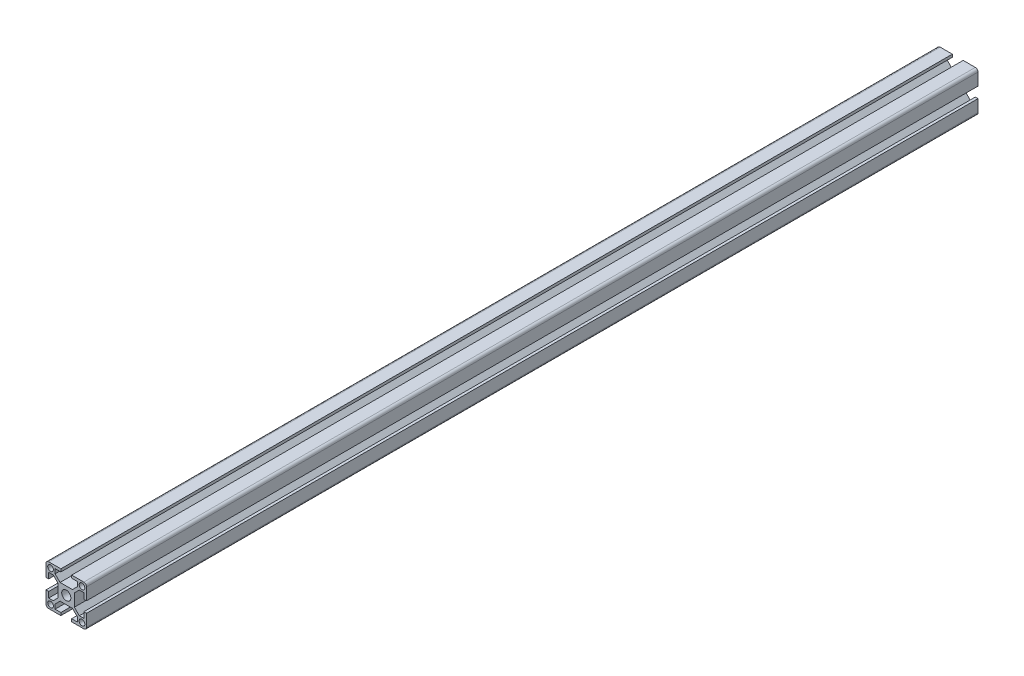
ISO-10303-21;
HEADER;
FILE_DESCRIPTION(('STEP AP214'),'2;1');
FILE_NAME('part.step','',(''),(''),'','','');
FILE_SCHEMA(('AUTOMOTIVE_DESIGN { 1 0 10303 214 1 1 1 1 }'));
ENDSEC;
DATA;
#1=APPLICATION_CONTEXT('core data for automotive mechanical design processes');
#2=APPLICATION_PROTOCOL_DEFINITION('international standard','automotive_design',2000,#1);
#3=PRODUCT_CONTEXT('',#1,'mechanical');
#4=PRODUCT('Part','Part','',(#3));
#5=PRODUCT_RELATED_PRODUCT_CATEGORY('part','',(#4));
#6=PRODUCT_DEFINITION_FORMATION('','',#4);
#7=PRODUCT_DEFINITION_CONTEXT('part definition',#1,'design');
#8=PRODUCT_DEFINITION('design','',#6,#7);
#9=PRODUCT_DEFINITION_SHAPE('','',#8);
#10=(LENGTH_UNIT() NAMED_UNIT(*) SI_UNIT(.MILLI.,.METRE.));
#11=(NAMED_UNIT(*) PLANE_ANGLE_UNIT() SI_UNIT($,.RADIAN.));
#12=(NAMED_UNIT(*) SI_UNIT($,.STERADIAN.) SOLID_ANGLE_UNIT());
#13=UNCERTAINTY_MEASURE_WITH_UNIT(LENGTH_MEASURE(1.E-05),#10,'distance_accuracy_value','');
#14=(GEOMETRIC_REPRESENTATION_CONTEXT(3) GLOBAL_UNCERTAINTY_ASSIGNED_CONTEXT((#13)) GLOBAL_UNIT_ASSIGNED_CONTEXT((#10,
#11,#12)) REPRESENTATION_CONTEXT('',''));
#15=CARTESIAN_POINT('',(0.,0.,0.));
#16=DIRECTION('',(0.,0.,1.));
#17=DIRECTION('',(1.,0.,0.));
#18=AXIS2_PLACEMENT_3D('',#15,#16,#17);
#19=CARTESIAN_POINT('',(13.,-13.,660.));
#20=DIRECTION('',(0.,0.,1.));
#21=DIRECTION('',(1.,0.,0.));
#22=AXIS2_PLACEMENT_3D('',#19,#20,#21);
#23=PLANE('',#22);
#24=CARTESIAN_POINT('',(11.625,-11.625,660.));
#25=DIRECTION('',(0.,0.,1.));
#26=DIRECTION('',(-1.,0.,0.));
#27=AXIS2_PLACEMENT_3D('',#24,#25,#26);
#28=CIRCLE('',#27,2.1);
#29=CARTESIAN_POINT('',(9.52500000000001,-11.625,660.));
#30=VERTEX_POINT('',#29);
#31=EDGE_CURVE('E762',#30,#30,#28,.T.);
#32=ORIENTED_EDGE('',*,*,#31,.F.);
#33=EDGE_LOOP('',(#32));
#34=FACE_BOUND('',#33,.T.);
#35=CARTESIAN_POINT('',(-11.625,11.625,660.));
#36=DIRECTION('',(0.,0.,1.));
#37=DIRECTION('',(1.,0.,0.));
#38=AXIS2_PLACEMENT_3D('',#35,#36,#37);
#39=CIRCLE('',#38,2.1);
#40=CARTESIAN_POINT('',(-9.52500000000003,11.625,660.));
#41=VERTEX_POINT('',#40);
#42=EDGE_CURVE('E774',#41,#41,#39,.T.);
#43=ORIENTED_EDGE('',*,*,#42,.F.);
#44=EDGE_LOOP('',(#43));
#45=FACE_BOUND('',#44,.T.);
#46=DIRECTION('',(-1.,0.,0.));
#47=VECTOR('',#46,1.);
#48=CARTESIAN_POINT('',(9.66421356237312,-8.25000000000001,660.));
#49=LINE('',#48,#47);
#50=CARTESIAN_POINT('',(13.,-8.25000000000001,660.));
#51=VERTEX_POINT('',#50);
#52=CARTESIAN_POINT('',(9.66421356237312,-8.25000000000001,660.));
#53=VERTEX_POINT('',#52);
#54=EDGE_CURVE('E463',#51,#53,#49,.T.);
#55=ORIENTED_EDGE('',*,*,#54,.T.);
#56=DIRECTION('',(-0.707106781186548,0.707106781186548,0.));
#57=VECTOR('',#56,1.);
#58=CARTESIAN_POINT('',(6.00000000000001,-4.58578643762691,660.));
#59=LINE('',#58,#57);
#60=CARTESIAN_POINT('',(6.00000000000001,-4.58578643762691,660.));
#61=VERTEX_POINT('',#60);
#62=EDGE_CURVE('E211',#53,#61,#59,.T.);
#63=ORIENTED_EDGE('',*,*,#62,.T.);
#64=DIRECTION('',(0.,1.,0.));
#65=VECTOR('',#64,1.);
#66=CARTESIAN_POINT('',(6.00000000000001,4.58578643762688,660.));
#67=LINE('',#66,#65);
#68=CARTESIAN_POINT('',(6.00000000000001,4.58578643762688,660.));
#69=VERTEX_POINT('',#68);
#70=EDGE_CURVE('E598',#61,#69,#67,.T.);
#71=ORIENTED_EDGE('',*,*,#70,.T.);
#72=DIRECTION('',(0.707106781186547,0.707106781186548,0.));
#73=VECTOR('',#72,1.);
#74=CARTESIAN_POINT('',(6.00000000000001,4.58578643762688,660.));
#75=LINE('',#74,#73);
#76=CARTESIAN_POINT('',(9.66421356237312,8.24999999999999,660.));
#77=VERTEX_POINT('',#76);
#78=EDGE_CURVE('E617',#69,#77,#75,.T.);
#79=ORIENTED_EDGE('',*,*,#78,.T.);
#80=DIRECTION('',(1.,0.,0.));
#81=VECTOR('',#80,1.);
#82=CARTESIAN_POINT('',(9.66421356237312,8.24999999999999,660.));
#83=LINE('',#82,#81);
#84=CARTESIAN_POINT('',(13.,8.24999999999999,660.));
#85=VERTEX_POINT('',#84);
#86=EDGE_CURVE('E614',#77,#85,#83,.T.);
#87=ORIENTED_EDGE('',*,*,#86,.T.);
#88=DIRECTION('',(0.,-1.,0.));
#89=VECTOR('',#88,1.);
#90=CARTESIAN_POINT('',(13.,8.24999999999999,660.));
#91=LINE('',#90,#89);
#92=CARTESIAN_POINT('',(13.,3.99999999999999,660.));
#93=VERTEX_POINT('',#92);
#94=EDGE_CURVE('E616',#85,#93,#91,.T.);
#95=ORIENTED_EDGE('',*,*,#94,.T.);
#96=DIRECTION('',(1.,0.,0.));
#97=VECTOR('',#96,1.);
#98=CARTESIAN_POINT('',(13.,3.99999999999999,660.));
#99=LINE('',#98,#97);
#100=CARTESIAN_POINT('',(15.,3.99999999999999,660.));
#101=VERTEX_POINT('',#100);
#102=EDGE_CURVE('E619',#93,#101,#99,.T.);
#103=ORIENTED_EDGE('',*,*,#102,.T.);
#104=DIRECTION('',(0.,1.,0.));
#105=VECTOR('',#104,1.);
#106=CARTESIAN_POINT('',(15.,13.,660.));
#107=LINE('',#106,#105);
#108=CARTESIAN_POINT('',(15.,13.,660.));
#109=VERTEX_POINT('',#108);
#110=EDGE_CURVE('E625',#101,#109,#107,.T.);
#111=ORIENTED_EDGE('',*,*,#110,.T.);
#112=CARTESIAN_POINT('',(13.,13.,660.));
#113=DIRECTION('',(0.,0.,1.));
#114=DIRECTION('',(-1.,0.,0.));
#115=AXIS2_PLACEMENT_3D('',#112,#113,#114);
#116=CIRCLE('',#115,2.);
#117=CARTESIAN_POINT('',(13.,15.,660.));
#118=VERTEX_POINT('',#117);
#119=EDGE_CURVE('E627',#109,#118,#116,.T.);
#120=ORIENTED_EDGE('',*,*,#119,.T.);
#121=DIRECTION('',(-1.,0.,0.));
#122=VECTOR('',#121,1.);
#123=CARTESIAN_POINT('',(3.99999999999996,15.,660.));
#124=LINE('',#123,#122);
#125=CARTESIAN_POINT('',(3.99999999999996,15.,660.));
#126=VERTEX_POINT('',#125);
#127=EDGE_CURVE('E629',#118,#126,#124,.T.);
#128=ORIENTED_EDGE('',*,*,#127,.T.);
#129=DIRECTION('',(0.,-1.,0.));
#130=VECTOR('',#129,1.);
#131=CARTESIAN_POINT('',(3.99999999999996,13.,660.));
#132=LINE('',#131,#130);
#133=CARTESIAN_POINT('',(3.99999999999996,13.,660.));
#134=VERTEX_POINT('',#133);
#135=EDGE_CURVE('E631',#126,#134,#132,.T.);
#136=ORIENTED_EDGE('',*,*,#135,.T.);
#137=DIRECTION('',(1.,0.,0.));
#138=VECTOR('',#137,1.);
#139=CARTESIAN_POINT('',(3.99999999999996,13.,660.));
#140=LINE('',#139,#138);
#141=CARTESIAN_POINT('',(8.24999999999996,13.,660.));
#142=VERTEX_POINT('',#141);
#143=EDGE_CURVE('E633',#134,#142,#140,.T.);
#144=ORIENTED_EDGE('',*,*,#143,.T.);
#145=DIRECTION('',(0.,-1.,0.));
#146=VECTOR('',#145,1.);
#147=CARTESIAN_POINT('',(8.24999999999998,9.66421356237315,660.));
#148=LINE('',#147,#146);
#149=CARTESIAN_POINT('',(8.24999999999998,9.66421356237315,660.));
#150=VERTEX_POINT('',#149);
#151=EDGE_CURVE('E635',#142,#150,#148,.T.);
#152=ORIENTED_EDGE('',*,*,#151,.T.);
#153=DIRECTION('',(-0.707106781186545,-0.70710678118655,0.));
#154=VECTOR('',#153,1.);
#155=CARTESIAN_POINT('',(4.58578643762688,6.00000000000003,660.));
#156=LINE('',#155,#154);
#157=CARTESIAN_POINT('',(4.58578643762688,6.00000000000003,660.));
#158=VERTEX_POINT('',#157);
#159=EDGE_CURVE('E637',#150,#158,#156,.T.);
#160=ORIENTED_EDGE('',*,*,#159,.T.);
#161=DIRECTION('',(-1.,0.,0.));
#162=VECTOR('',#161,1.);
#163=CARTESIAN_POINT('',(-4.5857864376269,5.99999999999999,660.));
#164=LINE('',#163,#162);
#165=CARTESIAN_POINT('',(-4.5857864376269,5.99999999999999,660.));
#166=VERTEX_POINT('',#165);
#167=EDGE_CURVE('E639',#158,#166,#164,.T.);
#168=ORIENTED_EDGE('',*,*,#167,.T.);
#169=DIRECTION('',(-0.70710678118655,0.707106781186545,0.));
#170=VECTOR('',#169,1.);
#171=CARTESIAN_POINT('',(-4.5857864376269,5.99999999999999,660.));
#172=LINE('',#171,#170);
#173=CARTESIAN_POINT('',(-8.25000000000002,9.66421356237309,660.));
#174=VERTEX_POINT('',#173);
#175=EDGE_CURVE('E641',#166,#174,#172,.T.);
#176=ORIENTED_EDGE('',*,*,#175,.T.);
#177=DIRECTION('',(0.,1.,0.));
#178=VECTOR('',#177,1.);
#179=CARTESIAN_POINT('',(-8.25000000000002,9.66421356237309,660.));
#180=LINE('',#179,#178);
#181=CARTESIAN_POINT('',(-8.25000000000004,13.,660.));
#182=VERTEX_POINT('',#181);
#183=EDGE_CURVE('E643',#174,#182,#180,.T.);
#184=ORIENTED_EDGE('',*,*,#183,.T.);
#185=DIRECTION('',(1.,0.,0.));
#186=VECTOR('',#185,1.);
#187=CARTESIAN_POINT('',(-8.25000000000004,13.,660.));
#188=LINE('',#187,#186);
#189=CARTESIAN_POINT('',(-4.00000000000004,13.,660.));
#190=VERTEX_POINT('',#189);
#191=EDGE_CURVE('E645',#182,#190,#188,.T.);
#192=ORIENTED_EDGE('',*,*,#191,.T.);
#193=DIRECTION('',(0.,1.,0.));
#194=VECTOR('',#193,1.);
#195=CARTESIAN_POINT('',(-4.00000000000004,13.,660.));
#196=LINE('',#195,#194);
#197=CARTESIAN_POINT('',(-4.00000000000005,15.,660.));
#198=VERTEX_POINT('',#197);
#199=EDGE_CURVE('E647',#190,#198,#196,.T.);
#200=ORIENTED_EDGE('',*,*,#199,.T.);
#201=DIRECTION('',(-1.,0.,0.));
#202=VECTOR('',#201,1.);
#203=CARTESIAN_POINT('',(-13.,15.,660.));
#204=LINE('',#203,#202);
#205=CARTESIAN_POINT('',(-13.,15.,660.));
#206=VERTEX_POINT('',#205);
#207=EDGE_CURVE('E649',#198,#206,#204,.T.);
#208=ORIENTED_EDGE('',*,*,#207,.T.);
#209=CARTESIAN_POINT('',(-13.,13.,660.));
#210=DIRECTION('',(0.,0.,1.));
#211=DIRECTION('',(1.,0.,0.));
#212=AXIS2_PLACEMENT_3D('',#209,#210,#211);
#213=CIRCLE('',#212,2.);
#214=CARTESIAN_POINT('',(-15.,13.,660.));
#215=VERTEX_POINT('',#214);
#216=EDGE_CURVE('E651',#206,#215,#213,.T.);
#217=ORIENTED_EDGE('',*,*,#216,.T.);
#218=DIRECTION('',(0.,-1.,0.));
#219=VECTOR('',#218,1.);
#220=CARTESIAN_POINT('',(-15.,13.,660.));
#221=LINE('',#220,#219);
#222=CARTESIAN_POINT('',(-15.,3.9999999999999,660.));
#223=VERTEX_POINT('',#222);
#224=EDGE_CURVE('E653',#215,#223,#221,.T.);
#225=ORIENTED_EDGE('',*,*,#224,.T.);
#226=DIRECTION('',(1.,0.,0.));
#227=VECTOR('',#226,1.);
#228=CARTESIAN_POINT('',(-13.,3.99999999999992,660.));
#229=LINE('',#228,#227);
#230=CARTESIAN_POINT('',(-13.,3.99999999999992,660.));
#231=VERTEX_POINT('',#230);
#232=EDGE_CURVE('E655',#223,#231,#229,.T.);
#233=ORIENTED_EDGE('',*,*,#232,.T.);
#234=DIRECTION('',(0.,1.,0.));
#235=VECTOR('',#234,1.);
#236=CARTESIAN_POINT('',(-13.,3.99999999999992,660.));
#237=LINE('',#236,#235);
#238=CARTESIAN_POINT('',(-13.0000000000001,8.24999999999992,660.));
#239=VERTEX_POINT('',#238);
#240=EDGE_CURVE('E657',#231,#239,#237,.T.);
#241=ORIENTED_EDGE('',*,*,#240,.T.);
#242=DIRECTION('',(1.,0.,0.));
#243=VECTOR('',#242,1.);
#244=CARTESIAN_POINT('',(-9.66421356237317,8.24999999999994,660.));
#245=LINE('',#244,#243);
#246=CARTESIAN_POINT('',(-9.66421356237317,8.24999999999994,660.));
#247=VERTEX_POINT('',#246);
#248=EDGE_CURVE('E659',#239,#247,#245,.T.);
#249=ORIENTED_EDGE('',*,*,#248,.T.);
#250=DIRECTION('',(0.707106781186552,-0.707106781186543,0.));
#251=VECTOR('',#250,1.);
#252=CARTESIAN_POINT('',(-6.00000000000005,4.58578643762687,660.));
#253=LINE('',#252,#251);
#254=CARTESIAN_POINT('',(-6.00000000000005,4.58578643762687,660.));
#255=VERTEX_POINT('',#254);
#256=EDGE_CURVE('E661',#247,#255,#253,.T.);
#257=ORIENTED_EDGE('',*,*,#256,.T.);
#258=DIRECTION('',(0.,-1.,0.));
#259=VECTOR('',#258,1.);
#260=CARTESIAN_POINT('',(-5.99999999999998,-4.58578643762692,660.));
#261=LINE('',#260,#259);
#262=CARTESIAN_POINT('',(-5.99999999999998,-4.58578643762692,660.));
#263=VERTEX_POINT('',#262);
#264=EDGE_CURVE('E663',#255,#263,#261,.T.);
#265=ORIENTED_EDGE('',*,*,#264,.T.);
#266=DIRECTION('',(-0.707106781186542,-0.707106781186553,0.));
#267=VECTOR('',#266,1.);
#268=CARTESIAN_POINT('',(-5.99999999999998,-4.58578643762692,660.));
#269=LINE('',#268,#267);
#270=CARTESIAN_POINT('',(-9.66421356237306,-8.25000000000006,660.));
#271=VERTEX_POINT('',#270);
#272=EDGE_CURVE('E665',#263,#271,#269,.T.);
#273=ORIENTED_EDGE('',*,*,#272,.T.);
#274=DIRECTION('',(-1.,0.,0.));
#275=VECTOR('',#274,1.);
#276=CARTESIAN_POINT('',(-9.66421356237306,-8.25000000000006,660.));
#277=LINE('',#276,#275);
#278=CARTESIAN_POINT('',(-13.,-8.25000000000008,660.));
#279=VERTEX_POINT('',#278);
#280=EDGE_CURVE('E667',#271,#279,#277,.T.);
#281=ORIENTED_EDGE('',*,*,#280,.T.);
#282=DIRECTION('',(0.,1.,0.));
#283=VECTOR('',#282,1.);
#284=CARTESIAN_POINT('',(-13.,-8.25000000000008,660.));
#285=LINE('',#284,#283);
#286=CARTESIAN_POINT('',(-13.,-4.00000000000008,660.));
#287=VERTEX_POINT('',#286);
#288=EDGE_CURVE('E669',#279,#287,#285,.T.);
#289=ORIENTED_EDGE('',*,*,#288,.T.);
#290=DIRECTION('',(-1.,0.,0.));
#291=VECTOR('',#290,1.);
#292=CARTESIAN_POINT('',(-13.,-4.00000000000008,660.));
#293=LINE('',#292,#291);
#294=CARTESIAN_POINT('',(-15.,-4.0000000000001,660.));
#295=VERTEX_POINT('',#294);
#296=EDGE_CURVE('E671',#287,#295,#293,.T.);
#297=ORIENTED_EDGE('',*,*,#296,.T.);
#298=DIRECTION('',(0.,-1.,0.));
#299=VECTOR('',#298,1.);
#300=CARTESIAN_POINT('',(-15.,-4.0000000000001,660.));
#301=LINE('',#300,#299);
#302=CARTESIAN_POINT('',(-15.,-13.,660.));
#303=VERTEX_POINT('',#302);
#304=EDGE_CURVE('E673',#295,#303,#301,.T.);
#305=ORIENTED_EDGE('',*,*,#304,.T.);
#306=CARTESIAN_POINT('',(-13.,-13.,660.));
#307=DIRECTION('',(0.,0.,1.));
#308=DIRECTION('',(1.,0.,0.));
#309=AXIS2_PLACEMENT_3D('',#306,#307,#308);
#310=CIRCLE('',#309,2.);
#311=CARTESIAN_POINT('',(-13.,-15.,660.));
#312=VERTEX_POINT('',#311);
#313=EDGE_CURVE('E675',#303,#312,#310,.T.);
#314=ORIENTED_EDGE('',*,*,#313,.T.);
#315=DIRECTION('',(1.,0.,0.));
#316=VECTOR('',#315,1.);
#317=CARTESIAN_POINT('',(-13.,-15.,660.));
#318=LINE('',#317,#316);
#319=CARTESIAN_POINT('',(-4.00000000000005,-15.,660.));
#320=VERTEX_POINT('',#319);
#321=EDGE_CURVE('E677',#312,#320,#318,.T.);
#322=ORIENTED_EDGE('',*,*,#321,.T.);
#323=DIRECTION('',(0.,1.,0.));
#324=VECTOR('',#323,1.);
#325=CARTESIAN_POINT('',(-4.00000000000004,-13.,660.));
#326=LINE('',#325,#324);
#327=CARTESIAN_POINT('',(-4.00000000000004,-13.,660.));
#328=VERTEX_POINT('',#327);
#329=EDGE_CURVE('E679',#320,#328,#326,.T.);
#330=ORIENTED_EDGE('',*,*,#329,.T.);
#331=DIRECTION('',(-1.,0.,0.));
#332=VECTOR('',#331,1.);
#333=CARTESIAN_POINT('',(-8.25000000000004,-13.,660.));
#334=LINE('',#333,#332);
#335=CARTESIAN_POINT('',(-8.25000000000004,-13.,660.));
#336=VERTEX_POINT('',#335);
#337=EDGE_CURVE('E681',#328,#336,#334,.T.);
#338=ORIENTED_EDGE('',*,*,#337,.T.);
#339=DIRECTION('',(0.,1.,0.));
#340=VECTOR('',#339,1.);
#341=CARTESIAN_POINT('',(-8.25000000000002,-9.6642135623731,660.));
#342=LINE('',#341,#340);
#343=CARTESIAN_POINT('',(-8.25000000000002,-9.6642135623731,660.));
#344=VERTEX_POINT('',#343);
#345=EDGE_CURVE('E683',#336,#344,#342,.T.);
#346=ORIENTED_EDGE('',*,*,#345,.T.);
#347=DIRECTION('',(0.707106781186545,0.70710678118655,0.));
#348=VECTOR('',#347,1.);
#349=CARTESIAN_POINT('',(-4.58578643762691,-5.99999999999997,660.));
#350=LINE('',#349,#348);
#351=CARTESIAN_POINT('',(-4.58578643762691,-5.99999999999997,660.));
#352=VERTEX_POINT('',#351);
#353=EDGE_CURVE('E685',#344,#352,#350,.T.);
#354=ORIENTED_EDGE('',*,*,#353,.T.);
#355=DIRECTION('',(1.,0.,0.));
#356=VECTOR('',#355,1.);
#357=CARTESIAN_POINT('',(-4.58578643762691,-5.99999999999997,660.));
#358=LINE('',#357,#356);
#359=CARTESIAN_POINT('',(4.58578643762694,-5.99999999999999,660.));
#360=VERTEX_POINT('',#359);
#361=EDGE_CURVE('E687',#352,#360,#358,.T.);
#362=ORIENTED_EDGE('',*,*,#361,.T.);
#363=DIRECTION('',(0.707106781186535,-0.70710678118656,0.));
#364=VECTOR('',#363,1.);
#365=CARTESIAN_POINT('',(4.58578643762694,-5.99999999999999,660.));
#366=LINE('',#365,#364);
#367=CARTESIAN_POINT('',(8.24999999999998,-9.66421356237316,660.));
#368=VERTEX_POINT('',#367);
#369=EDGE_CURVE('E689',#360,#368,#366,.T.);
#370=ORIENTED_EDGE('',*,*,#369,.T.);
#371=DIRECTION('',(0.,-1.,0.));
#372=VECTOR('',#371,1.);
#373=CARTESIAN_POINT('',(8.24999999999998,-9.66421356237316,660.));
#374=LINE('',#373,#372);
#375=CARTESIAN_POINT('',(8.24999999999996,-13.0000000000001,660.));
#376=VERTEX_POINT('',#375);
#377=EDGE_CURVE('E691',#368,#376,#374,.T.);
#378=ORIENTED_EDGE('',*,*,#377,.T.);
#379=DIRECTION('',(-1.,0.,0.));
#380=VECTOR('',#379,1.);
#381=CARTESIAN_POINT('',(3.99999999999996,-13.,660.));
#382=LINE('',#381,#380);
#383=CARTESIAN_POINT('',(3.99999999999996,-13.,660.));
#384=VERTEX_POINT('',#383);
#385=EDGE_CURVE('E693',#376,#384,#382,.T.);
#386=ORIENTED_EDGE('',*,*,#385,.T.);
#387=DIRECTION('',(0.,-1.,0.));
#388=VECTOR('',#387,1.);
#389=CARTESIAN_POINT('',(3.99999999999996,-13.,660.));
#390=LINE('',#389,#388);
#391=CARTESIAN_POINT('',(3.99999999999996,-15.,660.));
#392=VERTEX_POINT('',#391);
#393=EDGE_CURVE('E695',#384,#392,#390,.T.);
#394=ORIENTED_EDGE('',*,*,#393,.T.);
#395=DIRECTION('',(1.,0.,0.));
#396=VECTOR('',#395,1.);
#397=CARTESIAN_POINT('',(3.99999999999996,-15.,660.));
#398=LINE('',#397,#396);
#399=CARTESIAN_POINT('',(13.,-15.,660.));
#400=VERTEX_POINT('',#399);
#401=EDGE_CURVE('E697',#392,#400,#398,.T.);
#402=ORIENTED_EDGE('',*,*,#401,.T.);
#403=CARTESIAN_POINT('',(13.,-13.,660.));
#404=DIRECTION('',(0.,0.,1.));
#405=DIRECTION('',(1.,0.,0.));
#406=AXIS2_PLACEMENT_3D('',#403,#404,#405);
#407=CIRCLE('',#406,2.);
#408=CARTESIAN_POINT('',(15.,-13.,660.));
#409=VERTEX_POINT('',#408);
#410=EDGE_CURVE('E350',#400,#409,#407,.T.);
#411=ORIENTED_EDGE('',*,*,#410,.T.);
#412=DIRECTION('',(0.,1.,0.));
#413=VECTOR('',#412,1.);
#414=CARTESIAN_POINT('',(15.,-4.00000000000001,660.));
#415=LINE('',#414,#413);
#416=CARTESIAN_POINT('',(15.,-4.00000000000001,660.));
#417=VERTEX_POINT('',#416);
#418=EDGE_CURVE('E344',#409,#417,#415,.T.);
#419=ORIENTED_EDGE('',*,*,#418,.T.);
#420=DIRECTION('',(-1.,0.,0.));
#421=VECTOR('',#420,1.);
#422=CARTESIAN_POINT('',(13.,-4.00000000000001,660.));
#423=LINE('',#422,#421);
#424=CARTESIAN_POINT('',(13.,-4.00000000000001,660.));
#425=VERTEX_POINT('',#424);
#426=EDGE_CURVE('E348',#417,#425,#423,.T.);
#427=ORIENTED_EDGE('',*,*,#426,.T.);
#428=DIRECTION('',(0.,-1.,0.));
#429=VECTOR('',#428,1.);
#430=CARTESIAN_POINT('',(13.,-4.00000000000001,660.));
#431=LINE('',#430,#429);
#432=EDGE_CURVE('E48',#425,#51,#431,.T.);
#433=ORIENTED_EDGE('',*,*,#432,.T.);
#434=EDGE_LOOP('',(#55,#63,#71,#79,#87,#95,#103,#111,#120,#128,#136,#144,#152,#160,#168,#176,
#184,#192,#200,#208,#217,#225,#233,#241,#249,#257,#265,#273,#281,#289,#297,#305,#314,#322,#330,
#338,#346,#354,#362,#370,#378,#386,#394,#402,#411,#419,#427,#433));
#435=FACE_BOUND('',#434,.T.);
#436=CARTESIAN_POINT('',(11.625,11.625,660.));
#437=DIRECTION('',(0.,0.,1.));
#438=DIRECTION('',(1.,0.,0.));
#439=AXIS2_PLACEMENT_3D('',#436,#437,#438);
#440=CIRCLE('',#439,2.1);
#441=CARTESIAN_POINT('',(13.725,11.625,660.));
#442=VERTEX_POINT('',#441);
#443=EDGE_CURVE('E372',#442,#442,#440,.T.);
#444=ORIENTED_EDGE('',*,*,#443,.F.);
#445=EDGE_LOOP('',(#444));
#446=FACE_BOUND('',#445,.T.);
#447=CARTESIAN_POINT('',(0.,0.,660.));
#448=DIRECTION('',(0.,0.,1.));
#449=DIRECTION('',(1.,0.,0.));
#450=AXIS2_PLACEMENT_3D('',#447,#448,#449);
#451=CIRCLE('',#450,3.4);
#452=CARTESIAN_POINT('',(3.40000000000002,0.,660.));
#453=VERTEX_POINT('',#452);
#454=EDGE_CURVE('E768',#453,#453,#451,.T.);
#455=ORIENTED_EDGE('',*,*,#454,.F.);
#456=EDGE_LOOP('',(#455));
#457=FACE_BOUND('',#456,.T.);
#458=CARTESIAN_POINT('',(-11.625,-11.625,660.));
#459=DIRECTION('',(0.,0.,1.));
#460=DIRECTION('',(-1.,0.,0.));
#461=AXIS2_PLACEMENT_3D('',#458,#459,#460);
#462=CIRCLE('',#461,2.1);
#463=CARTESIAN_POINT('',(-13.725,-11.625,660.));
#464=VERTEX_POINT('',#463);
#465=EDGE_CURVE('E753',#464,#464,#462,.T.);
#466=ORIENTED_EDGE('',*,*,#465,.F.);
#467=EDGE_LOOP('',(#466));
#468=FACE_BOUND('',#467,.T.);
#469=ADVANCED_FACE('F31',(#34,#45,#435,#446,#457,#468),#23,.T.);
#470=CARTESIAN_POINT('',(13.,-13.,0.));
#471=DIRECTION('',(0.,0.,1.));
#472=DIRECTION('',(1.,0.,0.));
#473=AXIS2_PLACEMENT_3D('',#470,#471,#472);
#474=PLANE('',#473);
#475=CARTESIAN_POINT('',(11.625,-11.625,0.));
#476=DIRECTION('',(0.,0.,1.));
#477=DIRECTION('',(-1.,0.,0.));
#478=AXIS2_PLACEMENT_3D('',#475,#476,#477);
#479=CIRCLE('',#478,2.1);
#480=CARTESIAN_POINT('',(9.52500000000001,-11.625,0.));
#481=VERTEX_POINT('',#480);
#482=EDGE_CURVE('E759',#481,#481,#479,.T.);
#483=ORIENTED_EDGE('',*,*,#482,.T.);
#484=EDGE_LOOP('',(#483));
#485=FACE_BOUND('',#484,.T.);
#486=CARTESIAN_POINT('',(-11.625,11.625,0.));
#487=DIRECTION('',(0.,0.,1.));
#488=DIRECTION('',(1.,0.,0.));
#489=AXIS2_PLACEMENT_3D('',#486,#487,#488);
#490=CIRCLE('',#489,2.1);
#491=CARTESIAN_POINT('',(-9.52500000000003,11.625,0.));
#492=VERTEX_POINT('',#491);
#493=EDGE_CURVE('E771',#492,#492,#490,.T.);
#494=ORIENTED_EDGE('',*,*,#493,.T.);
#495=EDGE_LOOP('',(#494));
#496=FACE_BOUND('',#495,.T.);
#497=DIRECTION('',(-1.,0.,0.));
#498=VECTOR('',#497,1.);
#499=CARTESIAN_POINT('',(9.66421356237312,-8.25000000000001,0.));
#500=LINE('',#499,#498);
#501=CARTESIAN_POINT('',(13.,-8.25000000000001,0.));
#502=VERTEX_POINT('',#501);
#503=CARTESIAN_POINT('',(9.66421356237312,-8.25000000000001,0.));
#504=VERTEX_POINT('',#503);
#505=EDGE_CURVE('E368',#502,#504,#500,.T.);
#506=ORIENTED_EDGE('',*,*,#505,.F.);
#507=DIRECTION('',(0.,-1.,0.));
#508=VECTOR('',#507,1.);
#509=CARTESIAN_POINT('',(13.,-4.00000000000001,0.));
#510=LINE('',#509,#508);
#511=CARTESIAN_POINT('',(13.,-4.00000000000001,0.));
#512=VERTEX_POINT('',#511);
#513=EDGE_CURVE('E203',#512,#502,#510,.T.);
#514=ORIENTED_EDGE('',*,*,#513,.F.);
#515=DIRECTION('',(-1.,0.,0.));
#516=VECTOR('',#515,1.);
#517=CARTESIAN_POINT('',(13.,-4.00000000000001,0.));
#518=LINE('',#517,#516);
#519=CARTESIAN_POINT('',(15.,-4.00000000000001,0.));
#520=VERTEX_POINT('',#519);
#521=EDGE_CURVE('E197',#520,#512,#518,.T.);
#522=ORIENTED_EDGE('',*,*,#521,.F.);
#523=DIRECTION('',(0.,1.,0.));
#524=VECTOR('',#523,1.);
#525=CARTESIAN_POINT('',(15.,-4.00000000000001,0.));
#526=LINE('',#525,#524);
#527=CARTESIAN_POINT('',(15.,-13.,0.));
#528=VERTEX_POINT('',#527);
#529=EDGE_CURVE('E358',#528,#520,#526,.T.);
#530=ORIENTED_EDGE('',*,*,#529,.F.);
#531=CARTESIAN_POINT('',(13.,-13.,0.));
#532=DIRECTION('',(0.,0.,1.));
#533=DIRECTION('',(1.,0.,0.));
#534=AXIS2_PLACEMENT_3D('',#531,#532,#533);
#535=CIRCLE('',#534,2.);
#536=CARTESIAN_POINT('',(13.,-15.,0.));
#537=VERTEX_POINT('',#536);
#538=EDGE_CURVE('E458',#537,#528,#535,.T.);
#539=ORIENTED_EDGE('',*,*,#538,.F.);
#540=DIRECTION('',(1.,0.,0.));
#541=VECTOR('',#540,1.);
#542=CARTESIAN_POINT('',(3.99999999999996,-15.,0.));
#543=LINE('',#542,#541);
#544=CARTESIAN_POINT('',(3.99999999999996,-15.,0.));
#545=VERTEX_POINT('',#544);
#546=EDGE_CURVE('E456',#545,#537,#543,.T.);
#547=ORIENTED_EDGE('',*,*,#546,.F.);
#548=DIRECTION('',(0.,-1.,0.));
#549=VECTOR('',#548,1.);
#550=CARTESIAN_POINT('',(3.99999999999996,-13.,0.));
#551=LINE('',#550,#549);
#552=CARTESIAN_POINT('',(3.99999999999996,-13.,0.));
#553=VERTEX_POINT('',#552);
#554=EDGE_CURVE('E454',#553,#545,#551,.T.);
#555=ORIENTED_EDGE('',*,*,#554,.F.);
#556=DIRECTION('',(-1.,0.,0.));
#557=VECTOR('',#556,1.);
#558=CARTESIAN_POINT('',(3.99999999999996,-13.,0.));
#559=LINE('',#558,#557);
#560=CARTESIAN_POINT('',(8.24999999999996,-13.0000000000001,0.));
#561=VERTEX_POINT('',#560);
#562=EDGE_CURVE('E452',#561,#553,#559,.T.);
#563=ORIENTED_EDGE('',*,*,#562,.F.);
#564=DIRECTION('',(0.,-1.,0.));
#565=VECTOR('',#564,1.);
#566=CARTESIAN_POINT('',(8.24999999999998,-9.66421356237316,0.));
#567=LINE('',#566,#565);
#568=CARTESIAN_POINT('',(8.24999999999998,-9.66421356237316,0.));
#569=VERTEX_POINT('',#568);
#570=EDGE_CURVE('E450',#569,#561,#567,.T.);
#571=ORIENTED_EDGE('',*,*,#570,.F.);
#572=DIRECTION('',(0.707106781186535,-0.70710678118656,0.));
#573=VECTOR('',#572,1.);
#574=CARTESIAN_POINT('',(4.58578643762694,-5.99999999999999,0.));
#575=LINE('',#574,#573);
#576=CARTESIAN_POINT('',(4.58578643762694,-5.99999999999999,0.));
#577=VERTEX_POINT('',#576);
#578=EDGE_CURVE('E448',#577,#569,#575,.T.);
#579=ORIENTED_EDGE('',*,*,#578,.F.);
#580=DIRECTION('',(1.,0.,0.));
#581=VECTOR('',#580,1.);
#582=CARTESIAN_POINT('',(-4.58578643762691,-5.99999999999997,0.));
#583=LINE('',#582,#581);
#584=CARTESIAN_POINT('',(-4.58578643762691,-5.99999999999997,0.));
#585=VERTEX_POINT('',#584);
#586=EDGE_CURVE('E446',#585,#577,#583,.T.);
#587=ORIENTED_EDGE('',*,*,#586,.F.);
#588=DIRECTION('',(0.707106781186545,0.70710678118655,0.));
#589=VECTOR('',#588,1.);
#590=CARTESIAN_POINT('',(-4.58578643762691,-5.99999999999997,0.));
#591=LINE('',#590,#589);
#592=CARTESIAN_POINT('',(-8.25000000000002,-9.6642135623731,0.));
#593=VERTEX_POINT('',#592);
#594=EDGE_CURVE('E444',#593,#585,#591,.T.);
#595=ORIENTED_EDGE('',*,*,#594,.F.);
#596=DIRECTION('',(0.,1.,0.));
#597=VECTOR('',#596,1.);
#598=CARTESIAN_POINT('',(-8.25000000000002,-9.6642135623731,0.));
#599=LINE('',#598,#597);
#600=CARTESIAN_POINT('',(-8.25000000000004,-13.,0.));
#601=VERTEX_POINT('',#600);
#602=EDGE_CURVE('E442',#601,#593,#599,.T.);
#603=ORIENTED_EDGE('',*,*,#602,.F.);
#604=DIRECTION('',(-1.,0.,0.));
#605=VECTOR('',#604,1.);
#606=CARTESIAN_POINT('',(-8.25000000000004,-13.,0.));
#607=LINE('',#606,#605);
#608=CARTESIAN_POINT('',(-4.00000000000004,-13.,0.));
#609=VERTEX_POINT('',#608);
#610=EDGE_CURVE('E440',#609,#601,#607,.T.);
#611=ORIENTED_EDGE('',*,*,#610,.F.);
#612=DIRECTION('',(0.,1.,0.));
#613=VECTOR('',#612,1.);
#614=CARTESIAN_POINT('',(-4.00000000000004,-13.,0.));
#615=LINE('',#614,#613);
#616=CARTESIAN_POINT('',(-4.00000000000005,-15.,0.));
#617=VERTEX_POINT('',#616);
#618=EDGE_CURVE('E438',#617,#609,#615,.T.);
#619=ORIENTED_EDGE('',*,*,#618,.F.);
#620=DIRECTION('',(1.,0.,0.));
#621=VECTOR('',#620,1.);
#622=CARTESIAN_POINT('',(-13.,-15.,0.));
#623=LINE('',#622,#621);
#624=CARTESIAN_POINT('',(-13.,-15.,0.));
#625=VERTEX_POINT('',#624);
#626=EDGE_CURVE('E436',#625,#617,#623,.T.);
#627=ORIENTED_EDGE('',*,*,#626,.F.);
#628=CARTESIAN_POINT('',(-13.,-13.,0.));
#629=DIRECTION('',(0.,0.,1.));
#630=DIRECTION('',(1.,0.,0.));
#631=AXIS2_PLACEMENT_3D('',#628,#629,#630);
#632=CIRCLE('',#631,2.);
#633=CARTESIAN_POINT('',(-15.,-13.,0.));
#634=VERTEX_POINT('',#633);
#635=EDGE_CURVE('E434',#634,#625,#632,.T.);
#636=ORIENTED_EDGE('',*,*,#635,.F.);
#637=DIRECTION('',(0.,-1.,0.));
#638=VECTOR('',#637,1.);
#639=CARTESIAN_POINT('',(-15.,-4.0000000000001,0.));
#640=LINE('',#639,#638);
#641=CARTESIAN_POINT('',(-15.,-4.0000000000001,0.));
#642=VERTEX_POINT('',#641);
#643=EDGE_CURVE('E432',#642,#634,#640,.T.);
#644=ORIENTED_EDGE('',*,*,#643,.F.);
#645=DIRECTION('',(-1.,0.,0.));
#646=VECTOR('',#645,1.);
#647=CARTESIAN_POINT('',(-13.,-4.00000000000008,0.));
#648=LINE('',#647,#646);
#649=CARTESIAN_POINT('',(-13.,-4.00000000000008,0.));
#650=VERTEX_POINT('',#649);
#651=EDGE_CURVE('E430',#650,#642,#648,.T.);
#652=ORIENTED_EDGE('',*,*,#651,.F.);
#653=DIRECTION('',(0.,1.,0.));
#654=VECTOR('',#653,1.);
#655=CARTESIAN_POINT('',(-13.,-8.25000000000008,0.));
#656=LINE('',#655,#654);
#657=CARTESIAN_POINT('',(-13.,-8.25000000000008,0.));
#658=VERTEX_POINT('',#657);
#659=EDGE_CURVE('E428',#658,#650,#656,.T.);
#660=ORIENTED_EDGE('',*,*,#659,.F.);
#661=DIRECTION('',(-1.,0.,0.));
#662=VECTOR('',#661,1.);
#663=CARTESIAN_POINT('',(-9.66421356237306,-8.25000000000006,0.));
#664=LINE('',#663,#662);
#665=CARTESIAN_POINT('',(-9.66421356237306,-8.25000000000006,0.));
#666=VERTEX_POINT('',#665);
#667=EDGE_CURVE('E426',#666,#658,#664,.T.);
#668=ORIENTED_EDGE('',*,*,#667,.F.);
#669=DIRECTION('',(-0.707106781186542,-0.707106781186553,0.));
#670=VECTOR('',#669,1.);
#671=CARTESIAN_POINT('',(-5.99999999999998,-4.58578643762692,0.));
#672=LINE('',#671,#670);
#673=CARTESIAN_POINT('',(-5.99999999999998,-4.58578643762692,0.));
#674=VERTEX_POINT('',#673);
#675=EDGE_CURVE('E424',#674,#666,#672,.T.);
#676=ORIENTED_EDGE('',*,*,#675,.F.);
#677=DIRECTION('',(0.,-1.,0.));
#678=VECTOR('',#677,1.);
#679=CARTESIAN_POINT('',(-5.99999999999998,-4.58578643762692,0.));
#680=LINE('',#679,#678);
#681=CARTESIAN_POINT('',(-6.00000000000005,4.58578643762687,0.));
#682=VERTEX_POINT('',#681);
#683=EDGE_CURVE('E422',#682,#674,#680,.T.);
#684=ORIENTED_EDGE('',*,*,#683,.F.);
#685=DIRECTION('',(0.707106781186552,-0.707106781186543,0.));
#686=VECTOR('',#685,1.);
#687=CARTESIAN_POINT('',(-6.00000000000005,4.58578643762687,0.));
#688=LINE('',#687,#686);
#689=CARTESIAN_POINT('',(-9.66421356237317,8.24999999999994,0.));
#690=VERTEX_POINT('',#689);
#691=EDGE_CURVE('E420',#690,#682,#688,.T.);
#692=ORIENTED_EDGE('',*,*,#691,.F.);
#693=DIRECTION('',(1.,0.,0.));
#694=VECTOR('',#693,1.);
#695=CARTESIAN_POINT('',(-9.66421356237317,8.24999999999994,0.));
#696=LINE('',#695,#694);
#697=CARTESIAN_POINT('',(-13.0000000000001,8.24999999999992,0.));
#698=VERTEX_POINT('',#697);
#699=EDGE_CURVE('E418',#698,#690,#696,.T.);
#700=ORIENTED_EDGE('',*,*,#699,.F.);
#701=DIRECTION('',(0.,1.,0.));
#702=VECTOR('',#701,1.);
#703=CARTESIAN_POINT('',(-13.,3.99999999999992,0.));
#704=LINE('',#703,#702);
#705=CARTESIAN_POINT('',(-13.,3.99999999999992,0.));
#706=VERTEX_POINT('',#705);
#707=EDGE_CURVE('E416',#706,#698,#704,.T.);
#708=ORIENTED_EDGE('',*,*,#707,.F.);
#709=DIRECTION('',(1.,0.,0.));
#710=VECTOR('',#709,1.);
#711=CARTESIAN_POINT('',(-13.,3.99999999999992,0.));
#712=LINE('',#711,#710);
#713=CARTESIAN_POINT('',(-15.,3.9999999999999,0.));
#714=VERTEX_POINT('',#713);
#715=EDGE_CURVE('E414',#714,#706,#712,.T.);
#716=ORIENTED_EDGE('',*,*,#715,.F.);
#717=DIRECTION('',(0.,-1.,0.));
#718=VECTOR('',#717,1.);
#719=CARTESIAN_POINT('',(-15.,13.,0.));
#720=LINE('',#719,#718);
#721=CARTESIAN_POINT('',(-15.,13.,0.));
#722=VERTEX_POINT('',#721);
#723=EDGE_CURVE('E412',#722,#714,#720,.T.);
#724=ORIENTED_EDGE('',*,*,#723,.F.);
#725=CARTESIAN_POINT('',(-13.,13.,0.));
#726=DIRECTION('',(0.,0.,1.));
#727=DIRECTION('',(1.,0.,0.));
#728=AXIS2_PLACEMENT_3D('',#725,#726,#727);
#729=CIRCLE('',#728,2.);
#730=CARTESIAN_POINT('',(-13.,15.,0.));
#731=VERTEX_POINT('',#730);
#732=EDGE_CURVE('E410',#731,#722,#729,.T.);
#733=ORIENTED_EDGE('',*,*,#732,.F.);
#734=DIRECTION('',(-1.,0.,0.));
#735=VECTOR('',#734,1.);
#736=CARTESIAN_POINT('',(-13.,15.,0.));
#737=LINE('',#736,#735);
#738=CARTESIAN_POINT('',(-4.00000000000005,15.,0.));
#739=VERTEX_POINT('',#738);
#740=EDGE_CURVE('E408',#739,#731,#737,.T.);
#741=ORIENTED_EDGE('',*,*,#740,.F.);
#742=DIRECTION('',(0.,1.,0.));
#743=VECTOR('',#742,1.);
#744=CARTESIAN_POINT('',(-4.00000000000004,13.,0.));
#745=LINE('',#744,#743);
#746=CARTESIAN_POINT('',(-4.00000000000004,13.,0.));
#747=VERTEX_POINT('',#746);
#748=EDGE_CURVE('E406',#747,#739,#745,.T.);
#749=ORIENTED_EDGE('',*,*,#748,.F.);
#750=DIRECTION('',(1.,0.,0.));
#751=VECTOR('',#750,1.);
#752=CARTESIAN_POINT('',(-8.25000000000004,13.,0.));
#753=LINE('',#752,#751);
#754=CARTESIAN_POINT('',(-8.25000000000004,13.,0.));
#755=VERTEX_POINT('',#754);
#756=EDGE_CURVE('E404',#755,#747,#753,.T.);
#757=ORIENTED_EDGE('',*,*,#756,.F.);
#758=DIRECTION('',(0.,1.,0.));
#759=VECTOR('',#758,1.);
#760=CARTESIAN_POINT('',(-8.25000000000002,9.66421356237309,0.));
#761=LINE('',#760,#759);
#762=CARTESIAN_POINT('',(-8.25000000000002,9.66421356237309,0.));
#763=VERTEX_POINT('',#762);
#764=EDGE_CURVE('E402',#763,#755,#761,.T.);
#765=ORIENTED_EDGE('',*,*,#764,.F.);
#766=DIRECTION('',(-0.70710678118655,0.707106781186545,0.));
#767=VECTOR('',#766,1.);
#768=CARTESIAN_POINT('',(-4.5857864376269,5.99999999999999,0.));
#769=LINE('',#768,#767);
#770=CARTESIAN_POINT('',(-4.5857864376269,5.99999999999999,0.));
#771=VERTEX_POINT('',#770);
#772=EDGE_CURVE('E400',#771,#763,#769,.T.);
#773=ORIENTED_EDGE('',*,*,#772,.F.);
#774=DIRECTION('',(-1.,0.,0.));
#775=VECTOR('',#774,1.);
#776=CARTESIAN_POINT('',(-4.5857864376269,5.99999999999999,0.));
#777=LINE('',#776,#775);
#778=CARTESIAN_POINT('',(4.58578643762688,6.00000000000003,0.));
#779=VERTEX_POINT('',#778);
#780=EDGE_CURVE('E398',#779,#771,#777,.T.);
#781=ORIENTED_EDGE('',*,*,#780,.F.);
#782=DIRECTION('',(-0.707106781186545,-0.70710678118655,0.));
#783=VECTOR('',#782,1.);
#784=CARTESIAN_POINT('',(4.58578643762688,6.00000000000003,0.));
#785=LINE('',#784,#783);
#786=CARTESIAN_POINT('',(8.24999999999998,9.66421356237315,0.));
#787=VERTEX_POINT('',#786);
#788=EDGE_CURVE('E396',#787,#779,#785,.T.);
#789=ORIENTED_EDGE('',*,*,#788,.F.);
#790=DIRECTION('',(0.,-1.,0.));
#791=VECTOR('',#790,1.);
#792=CARTESIAN_POINT('',(8.24999999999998,9.66421356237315,0.));
#793=LINE('',#792,#791);
#794=CARTESIAN_POINT('',(8.24999999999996,13.,0.));
#795=VERTEX_POINT('',#794);
#796=EDGE_CURVE('E394',#795,#787,#793,.T.);
#797=ORIENTED_EDGE('',*,*,#796,.F.);
#798=DIRECTION('',(1.,0.,0.));
#799=VECTOR('',#798,1.);
#800=CARTESIAN_POINT('',(3.99999999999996,13.,0.));
#801=LINE('',#800,#799);
#802=CARTESIAN_POINT('',(3.99999999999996,13.,0.));
#803=VERTEX_POINT('',#802);
#804=EDGE_CURVE('E392',#803,#795,#801,.T.);
#805=ORIENTED_EDGE('',*,*,#804,.F.);
#806=DIRECTION('',(0.,-1.,0.));
#807=VECTOR('',#806,1.);
#808=CARTESIAN_POINT('',(3.99999999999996,13.,0.));
#809=LINE('',#808,#807);
#810=CARTESIAN_POINT('',(3.99999999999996,15.,0.));
#811=VERTEX_POINT('',#810);
#812=EDGE_CURVE('E390',#811,#803,#809,.T.);
#813=ORIENTED_EDGE('',*,*,#812,.F.);
#814=DIRECTION('',(-1.,0.,0.));
#815=VECTOR('',#814,1.);
#816=CARTESIAN_POINT('',(3.99999999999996,15.,0.));
#817=LINE('',#816,#815);
#818=CARTESIAN_POINT('',(13.,15.,0.));
#819=VERTEX_POINT('',#818);
#820=EDGE_CURVE('E388',#819,#811,#817,.T.);
#821=ORIENTED_EDGE('',*,*,#820,.F.);
#822=CARTESIAN_POINT('',(13.,13.,0.));
#823=DIRECTION('',(0.,0.,1.));
#824=DIRECTION('',(-1.,0.,0.));
#825=AXIS2_PLACEMENT_3D('',#822,#823,#824);
#826=CIRCLE('',#825,2.);
#827=CARTESIAN_POINT('',(15.,13.,0.));
#828=VERTEX_POINT('',#827);
#829=EDGE_CURVE('E386',#828,#819,#826,.T.);
#830=ORIENTED_EDGE('',*,*,#829,.F.);
#831=DIRECTION('',(0.,1.,0.));
#832=VECTOR('',#831,1.);
#833=CARTESIAN_POINT('',(15.,13.,0.));
#834=LINE('',#833,#832);
#835=CARTESIAN_POINT('',(15.,3.99999999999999,0.));
#836=VERTEX_POINT('',#835);
#837=EDGE_CURVE('E384',#836,#828,#834,.T.);
#838=ORIENTED_EDGE('',*,*,#837,.F.);
#839=DIRECTION('',(1.,0.,0.));
#840=VECTOR('',#839,1.);
#841=CARTESIAN_POINT('',(13.,3.99999999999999,0.));
#842=LINE('',#841,#840);
#843=CARTESIAN_POINT('',(13.,3.99999999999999,0.));
#844=VERTEX_POINT('',#843);
#845=EDGE_CURVE('E382',#844,#836,#842,.T.);
#846=ORIENTED_EDGE('',*,*,#845,.F.);
#847=DIRECTION('',(0.,-1.,0.));
#848=VECTOR('',#847,1.);
#849=CARTESIAN_POINT('',(13.,8.24999999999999,0.));
#850=LINE('',#849,#848);
#851=CARTESIAN_POINT('',(13.,8.24999999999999,0.));
#852=VERTEX_POINT('',#851);
#853=EDGE_CURVE('E380',#852,#844,#850,.T.);
#854=ORIENTED_EDGE('',*,*,#853,.F.);
#855=DIRECTION('',(1.,0.,0.));
#856=VECTOR('',#855,1.);
#857=CARTESIAN_POINT('',(9.66421356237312,8.24999999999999,0.));
#858=LINE('',#857,#856);
#859=CARTESIAN_POINT('',(9.66421356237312,8.24999999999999,0.));
#860=VERTEX_POINT('',#859);
#861=EDGE_CURVE('E378',#860,#852,#858,.T.);
#862=ORIENTED_EDGE('',*,*,#861,.F.);
#863=DIRECTION('',(0.707106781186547,0.707106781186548,0.));
#864=VECTOR('',#863,1.);
#865=CARTESIAN_POINT('',(6.00000000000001,4.58578643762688,0.));
#866=LINE('',#865,#864);
#867=CARTESIAN_POINT('',(6.00000000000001,4.58578643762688,0.));
#868=VERTEX_POINT('',#867);
#869=EDGE_CURVE('E376',#868,#860,#866,.T.);
#870=ORIENTED_EDGE('',*,*,#869,.F.);
#871=DIRECTION('',(0.,1.,0.));
#872=VECTOR('',#871,1.);
#873=CARTESIAN_POINT('',(6.00000000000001,4.58578643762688,0.));
#874=LINE('',#873,#872);
#875=CARTESIAN_POINT('',(6.00000000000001,-4.58578643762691,0.));
#876=VERTEX_POINT('',#875);
#877=EDGE_CURVE('E374',#876,#868,#874,.T.);
#878=ORIENTED_EDGE('',*,*,#877,.F.);
#879=DIRECTION('',(-0.707106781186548,0.707106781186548,0.));
#880=VECTOR('',#879,1.);
#881=CARTESIAN_POINT('',(6.00000000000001,-4.58578643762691,0.));
#882=LINE('',#881,#880);
#883=EDGE_CURVE('E371',#504,#876,#882,.T.);
#884=ORIENTED_EDGE('',*,*,#883,.F.);
#885=EDGE_LOOP('',(#506,#514,#522,#530,#539,#547,#555,#563,#571,#579,#587,#595,#603,#611,#619,
#627,#636,#644,#652,#660,#668,#676,#684,#692,#700,#708,#716,#724,#733,#741,#749,#757,#765,#773,
#781,#789,#797,#805,#813,#821,#830,#838,#846,#854,#862,#870,#878,#884));
#886=FACE_BOUND('',#885,.T.);
#887=CARTESIAN_POINT('',(11.625,11.625,0.));
#888=DIRECTION('',(0.,0.,1.));
#889=DIRECTION('',(1.,0.,0.));
#890=AXIS2_PLACEMENT_3D('',#887,#888,#889);
#891=CIRCLE('',#890,2.1);
#892=CARTESIAN_POINT('',(13.725,11.625,0.));
#893=VERTEX_POINT('',#892);
#894=EDGE_CURVE('E777',#893,#893,#891,.T.);
#895=ORIENTED_EDGE('',*,*,#894,.T.);
#896=EDGE_LOOP('',(#895));
#897=FACE_BOUND('',#896,.T.);
#898=CARTESIAN_POINT('',(0.,0.,0.));
#899=DIRECTION('',(0.,0.,1.));
#900=DIRECTION('',(1.,0.,0.));
#901=AXIS2_PLACEMENT_3D('',#898,#899,#900);
#902=CIRCLE('',#901,3.4);
#903=CARTESIAN_POINT('',(3.40000000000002,0.,0.));
#904=VERTEX_POINT('',#903);
#905=EDGE_CURVE('E765',#904,#904,#902,.T.);
#906=ORIENTED_EDGE('',*,*,#905,.T.);
#907=EDGE_LOOP('',(#906));
#908=FACE_BOUND('',#907,.T.);
#909=CARTESIAN_POINT('',(-11.625,-11.625,0.));
#910=DIRECTION('',(0.,0.,1.));
#911=DIRECTION('',(-1.,0.,0.));
#912=AXIS2_PLACEMENT_3D('',#909,#910,#911);
#913=CIRCLE('',#912,2.1);
#914=CARTESIAN_POINT('',(-13.725,-11.625,0.));
#915=VERTEX_POINT('',#914);
#916=EDGE_CURVE('E756',#915,#915,#913,.T.);
#917=ORIENTED_EDGE('',*,*,#916,.T.);
#918=EDGE_LOOP('',(#917));
#919=FACE_BOUND('',#918,.T.);
#920=ADVANCED_FACE('F602',(#485,#496,#886,#897,#908,#919),#474,.F.);
#921=CARTESIAN_POINT('',(9.66421356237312,-8.25000000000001,660.));
#922=DIRECTION('',(0.,-1.,0.));
#923=DIRECTION('',(1.,0.,0.));
#924=AXIS2_PLACEMENT_3D('',#921,#922,#923);
#925=PLANE('',#924);
#926=ORIENTED_EDGE('',*,*,#505,.T.);
#927=DIRECTION('',(0.,0.,-1.));
#928=VECTOR('',#927,1.);
#929=CARTESIAN_POINT('',(9.66421356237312,-8.25000000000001,660.));
#930=LINE('',#929,#928);
#931=EDGE_CURVE('E11',#53,#504,#930,.T.);
#932=ORIENTED_EDGE('',*,*,#931,.F.);
#933=ORIENTED_EDGE('',*,*,#54,.F.);
#934=DIRECTION('',(0.,0.,-1.));
#935=VECTOR('',#934,1.);
#936=CARTESIAN_POINT('',(13.,-8.25000000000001,660.));
#937=LINE('',#936,#935);
#938=EDGE_CURVE('E364',#51,#502,#937,.T.);
#939=ORIENTED_EDGE('',*,*,#938,.T.);
#940=EDGE_LOOP('',(#926,#932,#933,#939));
#941=FACE_BOUND('',#940,.T.);
#942=ADVANCED_FACE('F33',(#941),#925,.F.);
#943=CARTESIAN_POINT('',(6.00000000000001,-4.58578643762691,660.));
#944=DIRECTION('',(-0.707106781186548,-0.707106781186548,0.));
#945=DIRECTION('',(0.707106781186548,-0.707106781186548,0.));
#946=AXIS2_PLACEMENT_3D('',#943,#944,#945);
#947=PLANE('',#946);
#948=ORIENTED_EDGE('',*,*,#883,.T.);
#949=DIRECTION('',(0.,0.,-1.));
#950=VECTOR('',#949,1.);
#951=CARTESIAN_POINT('',(6.00000000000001,-4.58578643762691,660.));
#952=LINE('',#951,#950);
#953=EDGE_CURVE('E40',#61,#876,#952,.T.);
#954=ORIENTED_EDGE('',*,*,#953,.F.);
#955=ORIENTED_EDGE('',*,*,#62,.F.);
#956=ORIENTED_EDGE('',*,*,#931,.T.);
#957=EDGE_LOOP('',(#948,#954,#955,#956));
#958=FACE_BOUND('',#957,.T.);
#959=ADVANCED_FACE('F1255',(#958),#947,.F.);
#960=CARTESIAN_POINT('',(6.00000000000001,4.58578643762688,660.));
#961=DIRECTION('',(-1.,0.,0.));
#962=DIRECTION('',(0.,-1.,0.));
#963=AXIS2_PLACEMENT_3D('',#960,#961,#962);
#964=PLANE('',#963);
#965=ORIENTED_EDGE('',*,*,#877,.T.);
#966=DIRECTION('',(0.,0.,-1.));
#967=VECTOR('',#966,1.);
#968=CARTESIAN_POINT('',(6.00000000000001,4.58578643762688,660.));
#969=LINE('',#968,#967);
#970=EDGE_CURVE('E590',#69,#868,#969,.T.);
#971=ORIENTED_EDGE('',*,*,#970,.F.);
#972=ORIENTED_EDGE('',*,*,#70,.F.);
#973=ORIENTED_EDGE('',*,*,#953,.T.);
#974=EDGE_LOOP('',(#965,#971,#972,#973));
#975=FACE_BOUND('',#974,.T.);
#976=ADVANCED_FACE('F596',(#975),#964,.F.);
#977=CARTESIAN_POINT('',(6.00000000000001,4.58578643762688,660.));
#978=DIRECTION('',(-0.707106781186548,0.707106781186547,0.));
#979=DIRECTION('',(-0.707106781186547,-0.707106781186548,0.));
#980=AXIS2_PLACEMENT_3D('',#977,#978,#979);
#981=PLANE('',#980);
#982=ORIENTED_EDGE('',*,*,#869,.T.);
#983=DIRECTION('',(0.,0.,-1.));
#984=VECTOR('',#983,1.);
#985=CARTESIAN_POINT('',(9.66421356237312,8.24999999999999,660.));
#986=LINE('',#985,#984);
#987=EDGE_CURVE('E587',#77,#860,#986,.T.);
#988=ORIENTED_EDGE('',*,*,#987,.F.);
#989=ORIENTED_EDGE('',*,*,#78,.F.);
#990=ORIENTED_EDGE('',*,*,#970,.T.);
#991=EDGE_LOOP('',(#982,#988,#989,#990));
#992=FACE_BOUND('',#991,.T.);
#993=ADVANCED_FACE('F608',(#992),#981,.F.);
#994=CARTESIAN_POINT('',(9.66421356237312,8.24999999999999,660.));
#995=DIRECTION('',(0.,1.,0.));
#996=DIRECTION('',(-1.,0.,0.));
#997=AXIS2_PLACEMENT_3D('',#994,#995,#996);
#998=PLANE('',#997);
#999=ORIENTED_EDGE('',*,*,#861,.T.);
#1000=DIRECTION('',(0.,0.,-1.));
#1001=VECTOR('',#1000,1.);
#1002=CARTESIAN_POINT('',(13.,8.24999999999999,660.));
#1003=LINE('',#1002,#1001);
#1004=EDGE_CURVE('E584',#85,#852,#1003,.T.);
#1005=ORIENTED_EDGE('',*,*,#1004,.F.);
#1006=ORIENTED_EDGE('',*,*,#86,.F.);
#1007=ORIENTED_EDGE('',*,*,#987,.T.);
#1008=EDGE_LOOP('',(#999,#1005,#1006,#1007));
#1009=FACE_BOUND('',#1008,.T.);
#1010=ADVANCED_FACE('F612',(#1009),#998,.F.);
#1011=CARTESIAN_POINT('',(13.,8.24999999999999,660.));
#1012=DIRECTION('',(1.,0.,0.));
#1013=DIRECTION('',(0.,0.,-1.));
#1014=AXIS2_PLACEMENT_3D('',#1011,#1012,#1013);
#1015=PLANE('',#1014);
#1016=ORIENTED_EDGE('',*,*,#853,.T.);
#1017=DIRECTION('',(0.,0.,-1.));
#1018=VECTOR('',#1017,1.);
#1019=CARTESIAN_POINT('',(13.,3.99999999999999,660.));
#1020=LINE('',#1019,#1018);
#1021=EDGE_CURVE('E581',#93,#844,#1020,.T.);
#1022=ORIENTED_EDGE('',*,*,#1021,.F.);
#1023=ORIENTED_EDGE('',*,*,#94,.F.);
#1024=ORIENTED_EDGE('',*,*,#1004,.T.);
#1025=EDGE_LOOP('',(#1016,#1022,#1023,#1024));
#1026=FACE_BOUND('',#1025,.T.);
#1027=ADVANCED_FACE('F1220',(#1026),#1015,.F.);
#1028=CARTESIAN_POINT('',(13.,3.99999999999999,660.));
#1029=DIRECTION('',(0.,1.,0.));
#1030=DIRECTION('',(0.,0.,1.));
#1031=AXIS2_PLACEMENT_3D('',#1028,#1029,#1030);
#1032=PLANE('',#1031);
#1033=ORIENTED_EDGE('',*,*,#845,.T.);
#1034=DIRECTION('',(0.,0.,-1.));
#1035=VECTOR('',#1034,1.);
#1036=CARTESIAN_POINT('',(15.,3.99999999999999,660.));
#1037=LINE('',#1036,#1035);
#1038=EDGE_CURVE('E578',#101,#836,#1037,.T.);
#1039=ORIENTED_EDGE('',*,*,#1038,.F.);
#1040=ORIENTED_EDGE('',*,*,#102,.F.);
#1041=ORIENTED_EDGE('',*,*,#1021,.T.);
#1042=EDGE_LOOP('',(#1033,#1039,#1040,#1041));
#1043=FACE_BOUND('',#1042,.T.);
#1044=ADVANCED_FACE('F1210',(#1043),#1032,.F.);
#1045=CARTESIAN_POINT('',(15.,13.,660.));
#1046=DIRECTION('',(-1.,0.,0.));
#1047=DIRECTION('',(0.,-1.,0.));
#1048=AXIS2_PLACEMENT_3D('',#1045,#1046,#1047);
#1049=PLANE('',#1048);
#1050=ORIENTED_EDGE('',*,*,#837,.T.);
#1051=DIRECTION('',(0.,0.,-1.));
#1052=VECTOR('',#1051,1.);
#1053=CARTESIAN_POINT('',(15.,13.,660.));
#1054=LINE('',#1053,#1052);
#1055=EDGE_CURVE('E575',#109,#828,#1054,.T.);
#1056=ORIENTED_EDGE('',*,*,#1055,.F.);
#1057=ORIENTED_EDGE('',*,*,#110,.F.);
#1058=ORIENTED_EDGE('',*,*,#1038,.T.);
#1059=EDGE_LOOP('',(#1050,#1056,#1057,#1058));
#1060=FACE_BOUND('',#1059,.T.);
#1061=ADVANCED_FACE('F1200',(#1060),#1049,.F.);
#1062=CARTESIAN_POINT('',(13.,13.,660.));
#1063=DIRECTION('',(0.,0.,-1.));
#1064=DIRECTION('',(-1.,0.,0.));
#1065=AXIS2_PLACEMENT_3D('',#1062,#1063,#1064);
#1066=CYLINDRICAL_SURFACE('',#1065,2.);
#1067=ORIENTED_EDGE('',*,*,#829,.T.);
#1068=DIRECTION('',(0.,0.,-1.));
#1069=VECTOR('',#1068,1.);
#1070=CARTESIAN_POINT('',(13.,15.,660.));
#1071=LINE('',#1070,#1069);
#1072=EDGE_CURVE('E572',#118,#819,#1071,.T.);
#1073=ORIENTED_EDGE('',*,*,#1072,.F.);
#1074=ORIENTED_EDGE('',*,*,#119,.F.);
#1075=ORIENTED_EDGE('',*,*,#1055,.T.);
#1076=EDGE_LOOP('',(#1067,#1073,#1074,#1075));
#1077=FACE_BOUND('',#1076,.T.);
#1078=ADVANCED_FACE('F1190',(#1077),#1066,.T.);
#1079=CARTESIAN_POINT('',(3.99999999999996,15.,660.));
#1080=DIRECTION('',(0.,-1.,0.));
#1081=DIRECTION('',(1.,0.,0.));
#1082=AXIS2_PLACEMENT_3D('',#1079,#1080,#1081);
#1083=PLANE('',#1082);
#1084=ORIENTED_EDGE('',*,*,#820,.T.);
#1085=DIRECTION('',(0.,0.,-1.));
#1086=VECTOR('',#1085,1.);
#1087=CARTESIAN_POINT('',(3.99999999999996,15.,660.));
#1088=LINE('',#1087,#1086);
#1089=EDGE_CURVE('E569',#126,#811,#1088,.T.);
#1090=ORIENTED_EDGE('',*,*,#1089,.F.);
#1091=ORIENTED_EDGE('',*,*,#127,.F.);
#1092=ORIENTED_EDGE('',*,*,#1072,.T.);
#1093=EDGE_LOOP('',(#1084,#1090,#1091,#1092));
#1094=FACE_BOUND('',#1093,.T.);
#1095=ADVANCED_FACE('F1180',(#1094),#1083,.F.);
#1096=CARTESIAN_POINT('',(3.99999999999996,13.,660.));
#1097=DIRECTION('',(1.,0.,0.));
#1098=DIRECTION('',(0.,1.,0.));
#1099=AXIS2_PLACEMENT_3D('',#1096,#1097,#1098);
#1100=PLANE('',#1099);
#1101=ORIENTED_EDGE('',*,*,#812,.T.);
#1102=DIRECTION('',(0.,0.,-1.));
#1103=VECTOR('',#1102,1.);
#1104=CARTESIAN_POINT('',(3.99999999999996,13.,660.));
#1105=LINE('',#1104,#1103);
#1106=EDGE_CURVE('E566',#134,#803,#1105,.T.);
#1107=ORIENTED_EDGE('',*,*,#1106,.F.);
#1108=ORIENTED_EDGE('',*,*,#135,.F.);
#1109=ORIENTED_EDGE('',*,*,#1089,.T.);
#1110=EDGE_LOOP('',(#1101,#1107,#1108,#1109));
#1111=FACE_BOUND('',#1110,.T.);
#1112=ADVANCED_FACE('F1170',(#1111),#1100,.F.);
#1113=CARTESIAN_POINT('',(3.99999999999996,13.,660.));
#1114=DIRECTION('',(0.,1.,0.));
#1115=DIRECTION('',(-1.,0.,0.));
#1116=AXIS2_PLACEMENT_3D('',#1113,#1114,#1115);
#1117=PLANE('',#1116);
#1118=ORIENTED_EDGE('',*,*,#804,.T.);
#1119=DIRECTION('',(0.,0.,-1.));
#1120=VECTOR('',#1119,1.);
#1121=CARTESIAN_POINT('',(8.24999999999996,13.,660.));
#1122=LINE('',#1121,#1120);
#1123=EDGE_CURVE('E563',#142,#795,#1122,.T.);
#1124=ORIENTED_EDGE('',*,*,#1123,.F.);
#1125=ORIENTED_EDGE('',*,*,#143,.F.);
#1126=ORIENTED_EDGE('',*,*,#1106,.T.);
#1127=EDGE_LOOP('',(#1118,#1124,#1125,#1126));
#1128=FACE_BOUND('',#1127,.T.);
#1129=ADVANCED_FACE('F1160',(#1128),#1117,.F.);
#1130=CARTESIAN_POINT('',(8.24999999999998,9.66421356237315,660.));
#1131=DIRECTION('',(1.,0.,0.));
#1132=DIRECTION('',(0.,1.,0.));
#1133=AXIS2_PLACEMENT_3D('',#1130,#1131,#1132);
#1134=PLANE('',#1133);
#1135=ORIENTED_EDGE('',*,*,#796,.T.);
#1136=DIRECTION('',(0.,0.,-1.));
#1137=VECTOR('',#1136,1.);
#1138=CARTESIAN_POINT('',(8.24999999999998,9.66421356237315,660.));
#1139=LINE('',#1138,#1137);
#1140=EDGE_CURVE('E560',#150,#787,#1139,.T.);
#1141=ORIENTED_EDGE('',*,*,#1140,.F.);
#1142=ORIENTED_EDGE('',*,*,#151,.F.);
#1143=ORIENTED_EDGE('',*,*,#1123,.T.);
#1144=EDGE_LOOP('',(#1135,#1141,#1142,#1143));
#1145=FACE_BOUND('',#1144,.T.);
#1146=ADVANCED_FACE('F1150',(#1145),#1134,.F.);
#1147=CARTESIAN_POINT('',(4.58578643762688,6.00000000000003,660.));
#1148=DIRECTION('',(0.70710678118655,-0.707106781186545,0.));
#1149=DIRECTION('',(0.707106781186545,0.70710678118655,0.));
#1150=AXIS2_PLACEMENT_3D('',#1147,#1148,#1149);
#1151=PLANE('',#1150);
#1152=ORIENTED_EDGE('',*,*,#788,.T.);
#1153=DIRECTION('',(0.,0.,-1.));
#1154=VECTOR('',#1153,1.);
#1155=CARTESIAN_POINT('',(4.58578643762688,6.00000000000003,660.));
#1156=LINE('',#1155,#1154);
#1157=EDGE_CURVE('E557',#158,#779,#1156,.T.);
#1158=ORIENTED_EDGE('',*,*,#1157,.F.);
#1159=ORIENTED_EDGE('',*,*,#159,.F.);
#1160=ORIENTED_EDGE('',*,*,#1140,.T.);
#1161=EDGE_LOOP('',(#1152,#1158,#1159,#1160));
#1162=FACE_BOUND('',#1161,.T.);
#1163=ADVANCED_FACE('F1140',(#1162),#1151,.F.);
#1164=CARTESIAN_POINT('',(-4.5857864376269,5.99999999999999,660.));
#1165=DIRECTION('',(0.,-1.,0.));
#1166=DIRECTION('',(1.,0.,0.));
#1167=AXIS2_PLACEMENT_3D('',#1164,#1165,#1166);
#1168=PLANE('',#1167);
#1169=ORIENTED_EDGE('',*,*,#780,.T.);
#1170=DIRECTION('',(0.,0.,-1.));
#1171=VECTOR('',#1170,1.);
#1172=CARTESIAN_POINT('',(-4.5857864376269,5.99999999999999,660.));
#1173=LINE('',#1172,#1171);
#1174=EDGE_CURVE('E554',#166,#771,#1173,.T.);
#1175=ORIENTED_EDGE('',*,*,#1174,.F.);
#1176=ORIENTED_EDGE('',*,*,#167,.F.);
#1177=ORIENTED_EDGE('',*,*,#1157,.T.);
#1178=EDGE_LOOP('',(#1169,#1175,#1176,#1177));
#1179=FACE_BOUND('',#1178,.T.);
#1180=ADVANCED_FACE('F1130',(#1179),#1168,.F.);
#1181=CARTESIAN_POINT('',(-4.5857864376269,5.99999999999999,660.));
#1182=DIRECTION('',(-0.707106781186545,-0.70710678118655,0.));
#1183=DIRECTION('',(0.70710678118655,-0.707106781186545,0.));
#1184=AXIS2_PLACEMENT_3D('',#1181,#1182,#1183);
#1185=PLANE('',#1184);
#1186=ORIENTED_EDGE('',*,*,#772,.T.);
#1187=DIRECTION('',(0.,0.,-1.));
#1188=VECTOR('',#1187,1.);
#1189=CARTESIAN_POINT('',(-8.25000000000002,9.66421356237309,660.));
#1190=LINE('',#1189,#1188);
#1191=EDGE_CURVE('E551',#174,#763,#1190,.T.);
#1192=ORIENTED_EDGE('',*,*,#1191,.F.);
#1193=ORIENTED_EDGE('',*,*,#175,.F.);
#1194=ORIENTED_EDGE('',*,*,#1174,.T.);
#1195=EDGE_LOOP('',(#1186,#1192,#1193,#1194));
#1196=FACE_BOUND('',#1195,.T.);
#1197=ADVANCED_FACE('F1120',(#1196),#1185,.F.);
#1198=CARTESIAN_POINT('',(-8.25000000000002,9.66421356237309,660.));
#1199=DIRECTION('',(-1.,0.,0.));
#1200=DIRECTION('',(0.,-1.,0.));
#1201=AXIS2_PLACEMENT_3D('',#1198,#1199,#1200);
#1202=PLANE('',#1201);
#1203=ORIENTED_EDGE('',*,*,#764,.T.);
#1204=DIRECTION('',(0.,0.,-1.));
#1205=VECTOR('',#1204,1.);
#1206=CARTESIAN_POINT('',(-8.25000000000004,13.,660.));
#1207=LINE('',#1206,#1205);
#1208=EDGE_CURVE('E548',#182,#755,#1207,.T.);
#1209=ORIENTED_EDGE('',*,*,#1208,.F.);
#1210=ORIENTED_EDGE('',*,*,#183,.F.);
#1211=ORIENTED_EDGE('',*,*,#1191,.T.);
#1212=EDGE_LOOP('',(#1203,#1209,#1210,#1211));
#1213=FACE_BOUND('',#1212,.T.);
#1214=ADVANCED_FACE('F1110',(#1213),#1202,.F.);
#1215=CARTESIAN_POINT('',(-8.25000000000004,13.,660.));
#1216=DIRECTION('',(0.,1.,0.));
#1217=DIRECTION('',(-1.,0.,0.));
#1218=AXIS2_PLACEMENT_3D('',#1215,#1216,#1217);
#1219=PLANE('',#1218);
#1220=ORIENTED_EDGE('',*,*,#756,.T.);
#1221=DIRECTION('',(0.,0.,-1.));
#1222=VECTOR('',#1221,1.);
#1223=CARTESIAN_POINT('',(-4.00000000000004,13.,660.));
#1224=LINE('',#1223,#1222);
#1225=EDGE_CURVE('E545',#190,#747,#1224,.T.);
#1226=ORIENTED_EDGE('',*,*,#1225,.F.);
#1227=ORIENTED_EDGE('',*,*,#191,.F.);
#1228=ORIENTED_EDGE('',*,*,#1208,.T.);
#1229=EDGE_LOOP('',(#1220,#1226,#1227,#1228));
#1230=FACE_BOUND('',#1229,.T.);
#1231=ADVANCED_FACE('F1100',(#1230),#1219,.F.);
#1232=CARTESIAN_POINT('',(-4.00000000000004,13.,660.));
#1233=DIRECTION('',(-1.,0.,0.));
#1234=DIRECTION('',(0.,-1.,0.));
#1235=AXIS2_PLACEMENT_3D('',#1232,#1233,#1234);
#1236=PLANE('',#1235);
#1237=ORIENTED_EDGE('',*,*,#748,.T.);
#1238=DIRECTION('',(0.,0.,-1.));
#1239=VECTOR('',#1238,1.);
#1240=CARTESIAN_POINT('',(-4.00000000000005,15.,660.));
#1241=LINE('',#1240,#1239);
#1242=EDGE_CURVE('E542',#198,#739,#1241,.T.);
#1243=ORIENTED_EDGE('',*,*,#1242,.F.);
#1244=ORIENTED_EDGE('',*,*,#199,.F.);
#1245=ORIENTED_EDGE('',*,*,#1225,.T.);
#1246=EDGE_LOOP('',(#1237,#1243,#1244,#1245));
#1247=FACE_BOUND('',#1246,.T.);
#1248=ADVANCED_FACE('F1090',(#1247),#1236,.F.);
#1249=CARTESIAN_POINT('',(-13.,15.,660.));
#1250=DIRECTION('',(0.,-1.,0.));
#1251=DIRECTION('',(1.,0.,0.));
#1252=AXIS2_PLACEMENT_3D('',#1249,#1250,#1251);
#1253=PLANE('',#1252);
#1254=ORIENTED_EDGE('',*,*,#740,.T.);
#1255=DIRECTION('',(0.,0.,-1.));
#1256=VECTOR('',#1255,1.);
#1257=CARTESIAN_POINT('',(-13.,15.,660.));
#1258=LINE('',#1257,#1256);
#1259=EDGE_CURVE('E539',#206,#731,#1258,.T.);
#1260=ORIENTED_EDGE('',*,*,#1259,.F.);
#1261=ORIENTED_EDGE('',*,*,#207,.F.);
#1262=ORIENTED_EDGE('',*,*,#1242,.T.);
#1263=EDGE_LOOP('',(#1254,#1260,#1261,#1262));
#1264=FACE_BOUND('',#1263,.T.);
#1265=ADVANCED_FACE('F1080',(#1264),#1253,.F.);
#1266=CARTESIAN_POINT('',(-13.,13.,660.));
#1267=DIRECTION('',(0.,0.,-1.));
#1268=DIRECTION('',(-1.,0.,0.));
#1269=AXIS2_PLACEMENT_3D('',#1266,#1267,#1268);
#1270=CYLINDRICAL_SURFACE('',#1269,2.);
#1271=ORIENTED_EDGE('',*,*,#732,.T.);
#1272=DIRECTION('',(0.,0.,-1.));
#1273=VECTOR('',#1272,1.);
#1274=CARTESIAN_POINT('',(-15.,13.,660.));
#1275=LINE('',#1274,#1273);
#1276=EDGE_CURVE('E536',#215,#722,#1275,.T.);
#1277=ORIENTED_EDGE('',*,*,#1276,.F.);
#1278=ORIENTED_EDGE('',*,*,#216,.F.);
#1279=ORIENTED_EDGE('',*,*,#1259,.T.);
#1280=EDGE_LOOP('',(#1271,#1277,#1278,#1279));
#1281=FACE_BOUND('',#1280,.T.);
#1282=ADVANCED_FACE('F1070',(#1281),#1270,.T.);
#1283=CARTESIAN_POINT('',(-15.,13.,660.));
#1284=DIRECTION('',(1.,0.,0.));
#1285=DIRECTION('',(0.,1.,0.));
#1286=AXIS2_PLACEMENT_3D('',#1283,#1284,#1285);
#1287=PLANE('',#1286);
#1288=ORIENTED_EDGE('',*,*,#723,.T.);
#1289=DIRECTION('',(0.,0.,-1.));
#1290=VECTOR('',#1289,1.);
#1291=CARTESIAN_POINT('',(-15.,3.9999999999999,660.));
#1292=LINE('',#1291,#1290);
#1293=EDGE_CURVE('E533',#223,#714,#1292,.T.);
#1294=ORIENTED_EDGE('',*,*,#1293,.F.);
#1295=ORIENTED_EDGE('',*,*,#224,.F.);
#1296=ORIENTED_EDGE('',*,*,#1276,.T.);
#1297=EDGE_LOOP('',(#1288,#1294,#1295,#1296));
#1298=FACE_BOUND('',#1297,.T.);
#1299=ADVANCED_FACE('F1060',(#1298),#1287,.F.);
#1300=CARTESIAN_POINT('',(-13.,3.99999999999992,660.));
#1301=DIRECTION('',(0.,1.,0.));
#1302=DIRECTION('',(-1.,0.,0.));
#1303=AXIS2_PLACEMENT_3D('',#1300,#1301,#1302);
#1304=PLANE('',#1303);
#1305=ORIENTED_EDGE('',*,*,#715,.T.);
#1306=DIRECTION('',(0.,0.,-1.));
#1307=VECTOR('',#1306,1.);
#1308=CARTESIAN_POINT('',(-13.,3.99999999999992,660.));
#1309=LINE('',#1308,#1307);
#1310=EDGE_CURVE('E530',#231,#706,#1309,.T.);
#1311=ORIENTED_EDGE('',*,*,#1310,.F.);
#1312=ORIENTED_EDGE('',*,*,#232,.F.);
#1313=ORIENTED_EDGE('',*,*,#1293,.T.);
#1314=EDGE_LOOP('',(#1305,#1311,#1312,#1313));
#1315=FACE_BOUND('',#1314,.T.);
#1316=ADVANCED_FACE('F1050',(#1315),#1304,.F.);
#1317=CARTESIAN_POINT('',(-13.,3.99999999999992,660.));
#1318=DIRECTION('',(-1.,0.,0.));
#1319=DIRECTION('',(0.,-1.,0.));
#1320=AXIS2_PLACEMENT_3D('',#1317,#1318,#1319);
#1321=PLANE('',#1320);
#1322=ORIENTED_EDGE('',*,*,#707,.T.);
#1323=DIRECTION('',(0.,0.,-1.));
#1324=VECTOR('',#1323,1.);
#1325=CARTESIAN_POINT('',(-13.0000000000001,8.24999999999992,660.));
#1326=LINE('',#1325,#1324);
#1327=EDGE_CURVE('E527',#239,#698,#1326,.T.);
#1328=ORIENTED_EDGE('',*,*,#1327,.F.);
#1329=ORIENTED_EDGE('',*,*,#240,.F.);
#1330=ORIENTED_EDGE('',*,*,#1310,.T.);
#1331=EDGE_LOOP('',(#1322,#1328,#1329,#1330));
#1332=FACE_BOUND('',#1331,.T.);
#1333=ADVANCED_FACE('F1040',(#1332),#1321,.F.);
#1334=CARTESIAN_POINT('',(-9.66421356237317,8.24999999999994,660.));
#1335=DIRECTION('',(0.,1.,0.));
#1336=DIRECTION('',(-1.,0.,0.));
#1337=AXIS2_PLACEMENT_3D('',#1334,#1335,#1336);
#1338=PLANE('',#1337);
#1339=ORIENTED_EDGE('',*,*,#699,.T.);
#1340=DIRECTION('',(0.,0.,-1.));
#1341=VECTOR('',#1340,1.);
#1342=CARTESIAN_POINT('',(-9.66421356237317,8.24999999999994,660.));
#1343=LINE('',#1342,#1341);
#1344=EDGE_CURVE('E524',#247,#690,#1343,.T.);
#1345=ORIENTED_EDGE('',*,*,#1344,.F.);
#1346=ORIENTED_EDGE('',*,*,#248,.F.);
#1347=ORIENTED_EDGE('',*,*,#1327,.T.);
#1348=EDGE_LOOP('',(#1339,#1345,#1346,#1347));
#1349=FACE_BOUND('',#1348,.T.);
#1350=ADVANCED_FACE('F1030',(#1349),#1338,.F.);
#1351=CARTESIAN_POINT('',(-6.00000000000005,4.58578643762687,660.));
#1352=DIRECTION('',(0.707106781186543,0.707106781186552,0.));
#1353=DIRECTION('',(-0.707106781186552,0.707106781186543,0.));
#1354=AXIS2_PLACEMENT_3D('',#1351,#1352,#1353);
#1355=PLANE('',#1354);
#1356=ORIENTED_EDGE('',*,*,#691,.T.);
#1357=DIRECTION('',(0.,0.,-1.));
#1358=VECTOR('',#1357,1.);
#1359=CARTESIAN_POINT('',(-6.00000000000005,4.58578643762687,660.));
#1360=LINE('',#1359,#1358);
#1361=EDGE_CURVE('E521',#255,#682,#1360,.T.);
#1362=ORIENTED_EDGE('',*,*,#1361,.F.);
#1363=ORIENTED_EDGE('',*,*,#256,.F.);
#1364=ORIENTED_EDGE('',*,*,#1344,.T.);
#1365=EDGE_LOOP('',(#1356,#1362,#1363,#1364));
#1366=FACE_BOUND('',#1365,.T.);
#1367=ADVANCED_FACE('F1020',(#1366),#1355,.F.);
#1368=CARTESIAN_POINT('',(-5.99999999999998,-4.58578643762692,660.));
#1369=DIRECTION('',(1.,0.,0.));
#1370=DIRECTION('',(0.,1.,0.));
#1371=AXIS2_PLACEMENT_3D('',#1368,#1369,#1370);
#1372=PLANE('',#1371);
#1373=ORIENTED_EDGE('',*,*,#683,.T.);
#1374=DIRECTION('',(0.,0.,-1.));
#1375=VECTOR('',#1374,1.);
#1376=CARTESIAN_POINT('',(-5.99999999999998,-4.58578643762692,660.));
#1377=LINE('',#1376,#1375);
#1378=EDGE_CURVE('E518',#263,#674,#1377,.T.);
#1379=ORIENTED_EDGE('',*,*,#1378,.F.);
#1380=ORIENTED_EDGE('',*,*,#264,.F.);
#1381=ORIENTED_EDGE('',*,*,#1361,.T.);
#1382=EDGE_LOOP('',(#1373,#1379,#1380,#1381));
#1383=FACE_BOUND('',#1382,.T.);
#1384=ADVANCED_FACE('F1010',(#1383),#1372,.F.);
#1385=CARTESIAN_POINT('',(-5.99999999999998,-4.58578643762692,660.));
#1386=DIRECTION('',(0.707106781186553,-0.707106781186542,0.));
#1387=DIRECTION('',(0.707106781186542,0.707106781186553,0.));
#1388=AXIS2_PLACEMENT_3D('',#1385,#1386,#1387);
#1389=PLANE('',#1388);
#1390=ORIENTED_EDGE('',*,*,#675,.T.);
#1391=DIRECTION('',(0.,0.,-1.));
#1392=VECTOR('',#1391,1.);
#1393=CARTESIAN_POINT('',(-9.66421356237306,-8.25000000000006,660.));
#1394=LINE('',#1393,#1392);
#1395=EDGE_CURVE('E515',#271,#666,#1394,.T.);
#1396=ORIENTED_EDGE('',*,*,#1395,.F.);
#1397=ORIENTED_EDGE('',*,*,#272,.F.);
#1398=ORIENTED_EDGE('',*,*,#1378,.T.);
#1399=EDGE_LOOP('',(#1390,#1396,#1397,#1398));
#1400=FACE_BOUND('',#1399,.T.);
#1401=ADVANCED_FACE('F1000',(#1400),#1389,.F.);
#1402=CARTESIAN_POINT('',(-9.66421356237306,-8.25000000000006,660.));
#1403=DIRECTION('',(0.,-1.,0.));
#1404=DIRECTION('',(1.,0.,0.));
#1405=AXIS2_PLACEMENT_3D('',#1402,#1403,#1404);
#1406=PLANE('',#1405);
#1407=ORIENTED_EDGE('',*,*,#667,.T.);
#1408=DIRECTION('',(0.,0.,-1.));
#1409=VECTOR('',#1408,1.);
#1410=CARTESIAN_POINT('',(-13.,-8.25000000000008,660.));
#1411=LINE('',#1410,#1409);
#1412=EDGE_CURVE('E512',#279,#658,#1411,.T.);
#1413=ORIENTED_EDGE('',*,*,#1412,.F.);
#1414=ORIENTED_EDGE('',*,*,#280,.F.);
#1415=ORIENTED_EDGE('',*,*,#1395,.T.);
#1416=EDGE_LOOP('',(#1407,#1413,#1414,#1415));
#1417=FACE_BOUND('',#1416,.T.);
#1418=ADVANCED_FACE('F990',(#1417),#1406,.F.);
#1419=CARTESIAN_POINT('',(-13.,-8.25000000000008,660.));
#1420=DIRECTION('',(-1.,0.,0.));
#1421=DIRECTION('',(0.,-1.,0.));
#1422=AXIS2_PLACEMENT_3D('',#1419,#1420,#1421);
#1423=PLANE('',#1422);
#1424=ORIENTED_EDGE('',*,*,#659,.T.);
#1425=DIRECTION('',(0.,0.,-1.));
#1426=VECTOR('',#1425,1.);
#1427=CARTESIAN_POINT('',(-13.,-4.00000000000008,660.));
#1428=LINE('',#1427,#1426);
#1429=EDGE_CURVE('E509',#287,#650,#1428,.T.);
#1430=ORIENTED_EDGE('',*,*,#1429,.F.);
#1431=ORIENTED_EDGE('',*,*,#288,.F.);
#1432=ORIENTED_EDGE('',*,*,#1412,.T.);
#1433=EDGE_LOOP('',(#1424,#1430,#1431,#1432));
#1434=FACE_BOUND('',#1433,.T.);
#1435=ADVANCED_FACE('F980',(#1434),#1423,.F.);
#1436=CARTESIAN_POINT('',(-13.,-4.00000000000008,660.));
#1437=DIRECTION('',(0.,-1.,0.));
#1438=DIRECTION('',(1.,0.,0.));
#1439=AXIS2_PLACEMENT_3D('',#1436,#1437,#1438);
#1440=PLANE('',#1439);
#1441=ORIENTED_EDGE('',*,*,#651,.T.);
#1442=DIRECTION('',(0.,0.,-1.));
#1443=VECTOR('',#1442,1.);
#1444=CARTESIAN_POINT('',(-15.,-4.0000000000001,660.));
#1445=LINE('',#1444,#1443);
#1446=EDGE_CURVE('E506',#295,#642,#1445,.T.);
#1447=ORIENTED_EDGE('',*,*,#1446,.F.);
#1448=ORIENTED_EDGE('',*,*,#296,.F.);
#1449=ORIENTED_EDGE('',*,*,#1429,.T.);
#1450=EDGE_LOOP('',(#1441,#1447,#1448,#1449));
#1451=FACE_BOUND('',#1450,.T.);
#1452=ADVANCED_FACE('F970',(#1451),#1440,.F.);
#1453=CARTESIAN_POINT('',(-15.,-4.0000000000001,660.));
#1454=DIRECTION('',(1.,0.,0.));
#1455=DIRECTION('',(0.,1.,0.));
#1456=AXIS2_PLACEMENT_3D('',#1453,#1454,#1455);
#1457=PLANE('',#1456);
#1458=ORIENTED_EDGE('',*,*,#643,.T.);
#1459=DIRECTION('',(0.,0.,-1.));
#1460=VECTOR('',#1459,1.);
#1461=CARTESIAN_POINT('',(-15.,-13.,660.));
#1462=LINE('',#1461,#1460);
#1463=EDGE_CURVE('E503',#303,#634,#1462,.T.);
#1464=ORIENTED_EDGE('',*,*,#1463,.F.);
#1465=ORIENTED_EDGE('',*,*,#304,.F.);
#1466=ORIENTED_EDGE('',*,*,#1446,.T.);
#1467=EDGE_LOOP('',(#1458,#1464,#1465,#1466));
#1468=FACE_BOUND('',#1467,.T.);
#1469=ADVANCED_FACE('F960',(#1468),#1457,.F.);
#1470=CARTESIAN_POINT('',(-13.,-13.,660.));
#1471=DIRECTION('',(0.,0.,-1.));
#1472=DIRECTION('',(-1.,0.,0.));
#1473=AXIS2_PLACEMENT_3D('',#1470,#1471,#1472);
#1474=CYLINDRICAL_SURFACE('',#1473,2.);
#1475=ORIENTED_EDGE('',*,*,#635,.T.);
#1476=DIRECTION('',(0.,0.,-1.));
#1477=VECTOR('',#1476,1.);
#1478=CARTESIAN_POINT('',(-13.,-15.,660.));
#1479=LINE('',#1478,#1477);
#1480=EDGE_CURVE('E500',#312,#625,#1479,.T.);
#1481=ORIENTED_EDGE('',*,*,#1480,.F.);
#1482=ORIENTED_EDGE('',*,*,#313,.F.);
#1483=ORIENTED_EDGE('',*,*,#1463,.T.);
#1484=EDGE_LOOP('',(#1475,#1481,#1482,#1483));
#1485=FACE_BOUND('',#1484,.T.);
#1486=ADVANCED_FACE('F950',(#1485),#1474,.T.);
#1487=CARTESIAN_POINT('',(-13.,-15.,660.));
#1488=DIRECTION('',(0.,1.,0.));
#1489=DIRECTION('',(-1.,0.,0.));
#1490=AXIS2_PLACEMENT_3D('',#1487,#1488,#1489);
#1491=PLANE('',#1490);
#1492=ORIENTED_EDGE('',*,*,#626,.T.);
#1493=DIRECTION('',(0.,0.,-1.));
#1494=VECTOR('',#1493,1.);
#1495=CARTESIAN_POINT('',(-4.00000000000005,-15.,660.));
#1496=LINE('',#1495,#1494);
#1497=EDGE_CURVE('E497',#320,#617,#1496,.T.);
#1498=ORIENTED_EDGE('',*,*,#1497,.F.);
#1499=ORIENTED_EDGE('',*,*,#321,.F.);
#1500=ORIENTED_EDGE('',*,*,#1480,.T.);
#1501=EDGE_LOOP('',(#1492,#1498,#1499,#1500));
#1502=FACE_BOUND('',#1501,.T.);
#1503=ADVANCED_FACE('F940',(#1502),#1491,.F.);
#1504=CARTESIAN_POINT('',(-4.00000000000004,-13.,660.));
#1505=DIRECTION('',(-1.,0.,0.));
#1506=DIRECTION('',(0.,-1.,0.));
#1507=AXIS2_PLACEMENT_3D('',#1504,#1505,#1506);
#1508=PLANE('',#1507);
#1509=ORIENTED_EDGE('',*,*,#618,.T.);
#1510=DIRECTION('',(0.,0.,-1.));
#1511=VECTOR('',#1510,1.);
#1512=CARTESIAN_POINT('',(-4.00000000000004,-13.,660.));
#1513=LINE('',#1512,#1511);
#1514=EDGE_CURVE('E494',#328,#609,#1513,.T.);
#1515=ORIENTED_EDGE('',*,*,#1514,.F.);
#1516=ORIENTED_EDGE('',*,*,#329,.F.);
#1517=ORIENTED_EDGE('',*,*,#1497,.T.);
#1518=EDGE_LOOP('',(#1509,#1515,#1516,#1517));
#1519=FACE_BOUND('',#1518,.T.);
#1520=ADVANCED_FACE('F930',(#1519),#1508,.F.);
#1521=CARTESIAN_POINT('',(-8.25000000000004,-13.,660.));
#1522=DIRECTION('',(0.,-1.,0.));
#1523=DIRECTION('',(1.,0.,0.));
#1524=AXIS2_PLACEMENT_3D('',#1521,#1522,#1523);
#1525=PLANE('',#1524);
#1526=ORIENTED_EDGE('',*,*,#610,.T.);
#1527=DIRECTION('',(0.,0.,-1.));
#1528=VECTOR('',#1527,1.);
#1529=CARTESIAN_POINT('',(-8.25000000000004,-13.,660.));
#1530=LINE('',#1529,#1528);
#1531=EDGE_CURVE('E491',#336,#601,#1530,.T.);
#1532=ORIENTED_EDGE('',*,*,#1531,.F.);
#1533=ORIENTED_EDGE('',*,*,#337,.F.);
#1534=ORIENTED_EDGE('',*,*,#1514,.T.);
#1535=EDGE_LOOP('',(#1526,#1532,#1533,#1534));
#1536=FACE_BOUND('',#1535,.T.);
#1537=ADVANCED_FACE('F920',(#1536),#1525,.F.);
#1538=CARTESIAN_POINT('',(-8.25000000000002,-9.6642135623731,660.));
#1539=DIRECTION('',(-1.,0.,0.));
#1540=DIRECTION('',(0.,-1.,0.));
#1541=AXIS2_PLACEMENT_3D('',#1538,#1539,#1540);
#1542=PLANE('',#1541);
#1543=ORIENTED_EDGE('',*,*,#602,.T.);
#1544=DIRECTION('',(0.,0.,-1.));
#1545=VECTOR('',#1544,1.);
#1546=CARTESIAN_POINT('',(-8.25000000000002,-9.6642135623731,660.));
#1547=LINE('',#1546,#1545);
#1548=EDGE_CURVE('E488',#344,#593,#1547,.T.);
#1549=ORIENTED_EDGE('',*,*,#1548,.F.);
#1550=ORIENTED_EDGE('',*,*,#345,.F.);
#1551=ORIENTED_EDGE('',*,*,#1531,.T.);
#1552=EDGE_LOOP('',(#1543,#1549,#1550,#1551));
#1553=FACE_BOUND('',#1552,.T.);
#1554=ADVANCED_FACE('F910',(#1553),#1542,.F.);
#1555=CARTESIAN_POINT('',(-4.58578643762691,-5.99999999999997,660.));
#1556=DIRECTION('',(-0.70710678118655,0.707106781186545,0.));
#1557=DIRECTION('',(-0.707106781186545,-0.70710678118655,0.));
#1558=AXIS2_PLACEMENT_3D('',#1555,#1556,#1557);
#1559=PLANE('',#1558);
#1560=ORIENTED_EDGE('',*,*,#594,.T.);
#1561=DIRECTION('',(0.,0.,-1.));
#1562=VECTOR('',#1561,1.);
#1563=CARTESIAN_POINT('',(-4.58578643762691,-5.99999999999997,660.));
#1564=LINE('',#1563,#1562);
#1565=EDGE_CURVE('E485',#352,#585,#1564,.T.);
#1566=ORIENTED_EDGE('',*,*,#1565,.F.);
#1567=ORIENTED_EDGE('',*,*,#353,.F.);
#1568=ORIENTED_EDGE('',*,*,#1548,.T.);
#1569=EDGE_LOOP('',(#1560,#1566,#1567,#1568));
#1570=FACE_BOUND('',#1569,.T.);
#1571=ADVANCED_FACE('F900',(#1570),#1559,.F.);
#1572=CARTESIAN_POINT('',(-4.58578643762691,-5.99999999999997,660.));
#1573=DIRECTION('',(0.,1.,0.));
#1574=DIRECTION('',(-1.,0.,0.));
#1575=AXIS2_PLACEMENT_3D('',#1572,#1573,#1574);
#1576=PLANE('',#1575);
#1577=ORIENTED_EDGE('',*,*,#586,.T.);
#1578=DIRECTION('',(0.,0.,-1.));
#1579=VECTOR('',#1578,1.);
#1580=CARTESIAN_POINT('',(4.58578643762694,-5.99999999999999,660.));
#1581=LINE('',#1580,#1579);
#1582=EDGE_CURVE('E482',#360,#577,#1581,.T.);
#1583=ORIENTED_EDGE('',*,*,#1582,.F.);
#1584=ORIENTED_EDGE('',*,*,#361,.F.);
#1585=ORIENTED_EDGE('',*,*,#1565,.T.);
#1586=EDGE_LOOP('',(#1577,#1583,#1584,#1585));
#1587=FACE_BOUND('',#1586,.T.);
#1588=ADVANCED_FACE('F890',(#1587),#1576,.F.);
#1589=CARTESIAN_POINT('',(4.58578643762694,-5.99999999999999,660.));
#1590=DIRECTION('',(0.70710678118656,0.707106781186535,0.));
#1591=DIRECTION('',(-0.707106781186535,0.70710678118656,0.));
#1592=AXIS2_PLACEMENT_3D('',#1589,#1590,#1591);
#1593=PLANE('',#1592);
#1594=ORIENTED_EDGE('',*,*,#578,.T.);
#1595=DIRECTION('',(0.,0.,-1.));
#1596=VECTOR('',#1595,1.);
#1597=CARTESIAN_POINT('',(8.24999999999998,-9.66421356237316,660.));
#1598=LINE('',#1597,#1596);
#1599=EDGE_CURVE('E479',#368,#569,#1598,.T.);
#1600=ORIENTED_EDGE('',*,*,#1599,.F.);
#1601=ORIENTED_EDGE('',*,*,#369,.F.);
#1602=ORIENTED_EDGE('',*,*,#1582,.T.);
#1603=EDGE_LOOP('',(#1594,#1600,#1601,#1602));
#1604=FACE_BOUND('',#1603,.T.);
#1605=ADVANCED_FACE('F880',(#1604),#1593,.F.);
#1606=CARTESIAN_POINT('',(8.24999999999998,-9.66421356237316,660.));
#1607=DIRECTION('',(1.,0.,0.));
#1608=DIRECTION('',(0.,1.,0.));
#1609=AXIS2_PLACEMENT_3D('',#1606,#1607,#1608);
#1610=PLANE('',#1609);
#1611=ORIENTED_EDGE('',*,*,#570,.T.);
#1612=DIRECTION('',(0.,0.,-1.));
#1613=VECTOR('',#1612,1.);
#1614=CARTESIAN_POINT('',(8.24999999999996,-13.0000000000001,660.));
#1615=LINE('',#1614,#1613);
#1616=EDGE_CURVE('E476',#376,#561,#1615,.T.);
#1617=ORIENTED_EDGE('',*,*,#1616,.F.);
#1618=ORIENTED_EDGE('',*,*,#377,.F.);
#1619=ORIENTED_EDGE('',*,*,#1599,.T.);
#1620=EDGE_LOOP('',(#1611,#1617,#1618,#1619));
#1621=FACE_BOUND('',#1620,.T.);
#1622=ADVANCED_FACE('F870',(#1621),#1610,.F.);
#1623=CARTESIAN_POINT('',(3.99999999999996,-13.,660.));
#1624=DIRECTION('',(0.,-1.,0.));
#1625=DIRECTION('',(1.,0.,0.));
#1626=AXIS2_PLACEMENT_3D('',#1623,#1624,#1625);
#1627=PLANE('',#1626);
#1628=ORIENTED_EDGE('',*,*,#562,.T.);
#1629=DIRECTION('',(0.,0.,-1.));
#1630=VECTOR('',#1629,1.);
#1631=CARTESIAN_POINT('',(3.99999999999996,-13.,660.));
#1632=LINE('',#1631,#1630);
#1633=EDGE_CURVE('E473',#384,#553,#1632,.T.);
#1634=ORIENTED_EDGE('',*,*,#1633,.F.);
#1635=ORIENTED_EDGE('',*,*,#385,.F.);
#1636=ORIENTED_EDGE('',*,*,#1616,.T.);
#1637=EDGE_LOOP('',(#1628,#1634,#1635,#1636));
#1638=FACE_BOUND('',#1637,.T.);
#1639=ADVANCED_FACE('F860',(#1638),#1627,.F.);
#1640=CARTESIAN_POINT('',(3.99999999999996,-13.,660.));
#1641=DIRECTION('',(1.,0.,0.));
#1642=DIRECTION('',(0.,1.,0.));
#1643=AXIS2_PLACEMENT_3D('',#1640,#1641,#1642);
#1644=PLANE('',#1643);
#1645=ORIENTED_EDGE('',*,*,#554,.T.);
#1646=DIRECTION('',(0.,0.,-1.));
#1647=VECTOR('',#1646,1.);
#1648=CARTESIAN_POINT('',(3.99999999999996,-15.,660.));
#1649=LINE('',#1648,#1647);
#1650=EDGE_CURVE('E470',#392,#545,#1649,.T.);
#1651=ORIENTED_EDGE('',*,*,#1650,.F.);
#1652=ORIENTED_EDGE('',*,*,#393,.F.);
#1653=ORIENTED_EDGE('',*,*,#1633,.T.);
#1654=EDGE_LOOP('',(#1645,#1651,#1652,#1653));
#1655=FACE_BOUND('',#1654,.T.);
#1656=ADVANCED_FACE('F851',(#1655),#1644,.F.);
#1657=CARTESIAN_POINT('',(3.99999999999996,-15.,660.));
#1658=DIRECTION('',(0.,1.,0.));
#1659=DIRECTION('',(-1.,0.,0.));
#1660=AXIS2_PLACEMENT_3D('',#1657,#1658,#1659);
#1661=PLANE('',#1660);
#1662=ORIENTED_EDGE('',*,*,#546,.T.);
#1663=DIRECTION('',(0.,0.,-1.));
#1664=VECTOR('',#1663,1.);
#1665=CARTESIAN_POINT('',(13.,-15.,660.));
#1666=LINE('',#1665,#1664);
#1667=EDGE_CURVE('E467',#400,#537,#1666,.T.);
#1668=ORIENTED_EDGE('',*,*,#1667,.F.);
#1669=ORIENTED_EDGE('',*,*,#401,.F.);
#1670=ORIENTED_EDGE('',*,*,#1650,.T.);
#1671=EDGE_LOOP('',(#1662,#1668,#1669,#1670));
#1672=FACE_BOUND('',#1671,.T.);
#1673=ADVANCED_FACE('F703',(#1672),#1661,.F.);
#1674=CARTESIAN_POINT('',(13.,-13.,660.));
#1675=DIRECTION('',(0.,0.,-1.));
#1676=DIRECTION('',(-1.,0.,0.));
#1677=AXIS2_PLACEMENT_3D('',#1674,#1675,#1676);
#1678=CYLINDRICAL_SURFACE('',#1677,2.);
#1679=ORIENTED_EDGE('',*,*,#538,.T.);
#1680=DIRECTION('',(0.,0.,-1.));
#1681=VECTOR('',#1680,1.);
#1682=CARTESIAN_POINT('',(15.,-13.,660.));
#1683=LINE('',#1682,#1681);
#1684=EDGE_CURVE('E359',#409,#528,#1683,.T.);
#1685=ORIENTED_EDGE('',*,*,#1684,.F.);
#1686=ORIENTED_EDGE('',*,*,#410,.F.);
#1687=ORIENTED_EDGE('',*,*,#1667,.T.);
#1688=EDGE_LOOP('',(#1679,#1685,#1686,#1687));
#1689=FACE_BOUND('',#1688,.T.);
#1690=ADVANCED_FACE('F707',(#1689),#1678,.T.);
#1691=CARTESIAN_POINT('',(15.,-4.00000000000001,660.));
#1692=DIRECTION('',(-1.,0.,0.));
#1693=DIRECTION('',(0.,-1.,0.));
#1694=AXIS2_PLACEMENT_3D('',#1691,#1692,#1693);
#1695=PLANE('',#1694);
#1696=ORIENTED_EDGE('',*,*,#529,.T.);
#1697=DIRECTION('',(0.,0.,-1.));
#1698=VECTOR('',#1697,1.);
#1699=CARTESIAN_POINT('',(15.,-4.00000000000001,660.));
#1700=LINE('',#1699,#1698);
#1701=EDGE_CURVE('E355',#417,#520,#1700,.T.);
#1702=ORIENTED_EDGE('',*,*,#1701,.F.);
#1703=ORIENTED_EDGE('',*,*,#418,.F.);
#1704=ORIENTED_EDGE('',*,*,#1684,.T.);
#1705=EDGE_LOOP('',(#1696,#1702,#1703,#1704));
#1706=FACE_BOUND('',#1705,.T.);
#1707=ADVANCED_FACE('F356',(#1706),#1695,.F.);
#1708=CARTESIAN_POINT('',(13.,-4.00000000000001,660.));
#1709=DIRECTION('',(0.,-1.,0.));
#1710=DIRECTION('',(0.,0.,-1.));
#1711=AXIS2_PLACEMENT_3D('',#1708,#1709,#1710);
#1712=PLANE('',#1711);
#1713=ORIENTED_EDGE('',*,*,#521,.T.);
#1714=DIRECTION('',(0.,0.,-1.));
#1715=VECTOR('',#1714,1.);
#1716=CARTESIAN_POINT('',(13.,-4.00000000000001,660.));
#1717=LINE('',#1716,#1715);
#1718=EDGE_CURVE('E360',#425,#512,#1717,.T.);
#1719=ORIENTED_EDGE('',*,*,#1718,.F.);
#1720=ORIENTED_EDGE('',*,*,#426,.F.);
#1721=ORIENTED_EDGE('',*,*,#1701,.T.);
#1722=EDGE_LOOP('',(#1713,#1719,#1720,#1721));
#1723=FACE_BOUND('',#1722,.T.);
#1724=ADVANCED_FACE('F362',(#1723),#1712,.F.);
#1725=CARTESIAN_POINT('',(13.,-4.00000000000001,660.));
#1726=DIRECTION('',(1.,0.,0.));
#1727=DIRECTION('',(0.,1.,0.));
#1728=AXIS2_PLACEMENT_3D('',#1725,#1726,#1727);
#1729=PLANE('',#1728);
#1730=ORIENTED_EDGE('',*,*,#513,.T.);
#1731=ORIENTED_EDGE('',*,*,#938,.F.);
#1732=ORIENTED_EDGE('',*,*,#432,.F.);
#1733=ORIENTED_EDGE('',*,*,#1718,.T.);
#1734=EDGE_LOOP('',(#1730,#1731,#1732,#1733));
#1735=FACE_BOUND('',#1734,.T.);
#1736=ADVANCED_FACE('F711',(#1735),#1729,.F.);
#1737=CARTESIAN_POINT('',(11.625,11.625,660.));
#1738=DIRECTION('',(0.,0.,-1.));
#1739=DIRECTION('',(-1.,0.,0.));
#1740=AXIS2_PLACEMENT_3D('',#1737,#1738,#1739);
#1741=CYLINDRICAL_SURFACE('',#1740,2.1);
#1742=ORIENTED_EDGE('',*,*,#443,.T.);
#1743=EDGE_LOOP('',(#1742));
#1744=FACE_BOUND('',#1743,.T.);
#1745=ORIENTED_EDGE('',*,*,#894,.F.);
#1746=EDGE_LOOP('',(#1745));
#1747=FACE_BOUND('',#1746,.T.);
#1748=ADVANCED_FACE('F713',(#1744,#1747),#1741,.F.);
#1749=CARTESIAN_POINT('',(-11.625,11.625,660.));
#1750=DIRECTION('',(0.,0.,-1.));
#1751=DIRECTION('',(-1.,0.,0.));
#1752=AXIS2_PLACEMENT_3D('',#1749,#1750,#1751);
#1753=CYLINDRICAL_SURFACE('',#1752,2.1);
#1754=ORIENTED_EDGE('',*,*,#42,.T.);
#1755=EDGE_LOOP('',(#1754));
#1756=FACE_BOUND('',#1755,.T.);
#1757=ORIENTED_EDGE('',*,*,#493,.F.);
#1758=EDGE_LOOP('',(#1757));
#1759=FACE_BOUND('',#1758,.T.);
#1760=ADVANCED_FACE('F719',(#1756,#1759),#1753,.F.);
#1761=CARTESIAN_POINT('',(0.,0.,660.));
#1762=DIRECTION('',(0.,0.,-1.));
#1763=DIRECTION('',(-1.,0.,0.));
#1764=AXIS2_PLACEMENT_3D('',#1761,#1762,#1763);
#1765=CYLINDRICAL_SURFACE('',#1764,3.4);
#1766=ORIENTED_EDGE('',*,*,#454,.T.);
#1767=EDGE_LOOP('',(#1766));
#1768=FACE_BOUND('',#1767,.T.);
#1769=ORIENTED_EDGE('',*,*,#905,.F.);
#1770=EDGE_LOOP('',(#1769));
#1771=FACE_BOUND('',#1770,.T.);
#1772=ADVANCED_FACE('F736',(#1768,#1771),#1765,.F.);
#1773=CARTESIAN_POINT('',(11.625,-11.625,660.));
#1774=DIRECTION('',(0.,0.,-1.));
#1775=DIRECTION('',(-1.,0.,0.));
#1776=AXIS2_PLACEMENT_3D('',#1773,#1774,#1775);
#1777=CYLINDRICAL_SURFACE('',#1776,2.1);
#1778=ORIENTED_EDGE('',*,*,#31,.T.);
#1779=EDGE_LOOP('',(#1778));
#1780=FACE_BOUND('',#1779,.T.);
#1781=ORIENTED_EDGE('',*,*,#482,.F.);
#1782=EDGE_LOOP('',(#1781));
#1783=FACE_BOUND('',#1782,.T.);
#1784=ADVANCED_FACE('F740',(#1780,#1783),#1777,.F.);
#1785=CARTESIAN_POINT('',(-11.625,-11.625,660.));
#1786=DIRECTION('',(0.,0.,-1.));
#1787=DIRECTION('',(-1.,0.,0.));
#1788=AXIS2_PLACEMENT_3D('',#1785,#1786,#1787);
#1789=CYLINDRICAL_SURFACE('',#1788,2.1);
#1790=ORIENTED_EDGE('',*,*,#465,.T.);
#1791=EDGE_LOOP('',(#1790));
#1792=FACE_BOUND('',#1791,.T.);
#1793=ORIENTED_EDGE('',*,*,#916,.F.);
#1794=EDGE_LOOP('',(#1793));
#1795=FACE_BOUND('',#1794,.T.);
#1796=ADVANCED_FACE('F744',(#1792,#1795),#1789,.F.);
#1797=CLOSED_SHELL('',(#469,#920,#942,#959,#976,#993,#1010,#1027,#1044,#1061,#1078,#1095,#1112,
#1129,#1146,#1163,#1180,#1197,#1214,#1231,#1248,#1265,#1282,#1299,#1316,#1333,#1350,#1367,#1384,
#1401,#1418,#1435,#1452,#1469,#1486,#1503,#1520,#1537,#1554,#1571,#1588,#1605,#1622,#1639,#1656,
#1673,#1690,#1707,#1724,#1736,#1748,#1760,#1772,#1784,#1796));
#1798=MANIFOLD_SOLID_BREP('B2',#1797);
#1799=ADVANCED_BREP_SHAPE_REPRESENTATION('',(#18,#1798),#14);
#1800=SHAPE_DEFINITION_REPRESENTATION(#9,#1799);
ENDSEC;
END-ISO-10303-21;
